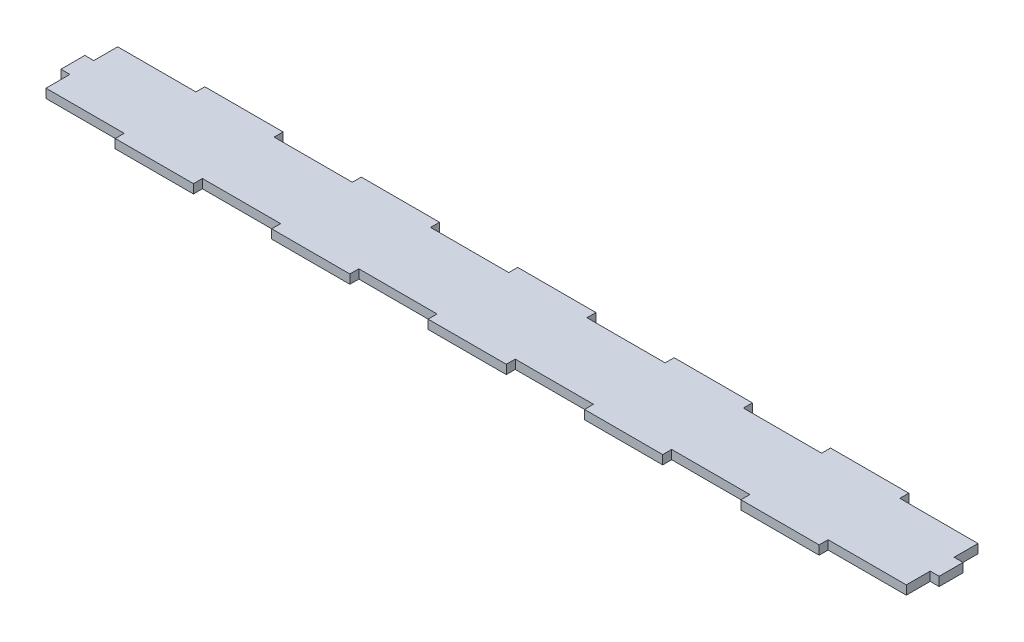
ISO-10303-21;
HEADER;
FILE_DESCRIPTION(('STEP AP214'),'2;1');
FILE_NAME('part.step','',(''),(''),'','','');
FILE_SCHEMA(('AUTOMOTIVE_DESIGN { 1 0 10303 214 1 1 1 1 }'));
ENDSEC;
DATA;
#1=APPLICATION_CONTEXT('core data for automotive mechanical design processes');
#2=APPLICATION_PROTOCOL_DEFINITION('international standard','automotive_design',2000,#1);
#3=PRODUCT_CONTEXT('',#1,'mechanical');
#4=PRODUCT('Part','Part','',(#3));
#5=PRODUCT_RELATED_PRODUCT_CATEGORY('part','',(#4));
#6=PRODUCT_DEFINITION_FORMATION('','',#4);
#7=PRODUCT_DEFINITION_CONTEXT('part definition',#1,'design');
#8=PRODUCT_DEFINITION('design','',#6,#7);
#9=PRODUCT_DEFINITION_SHAPE('','',#8);
#10=(LENGTH_UNIT() NAMED_UNIT(*) SI_UNIT(.MILLI.,.METRE.));
#11=(NAMED_UNIT(*) PLANE_ANGLE_UNIT() SI_UNIT($,.RADIAN.));
#12=(NAMED_UNIT(*) SI_UNIT($,.STERADIAN.) SOLID_ANGLE_UNIT());
#13=UNCERTAINTY_MEASURE_WITH_UNIT(LENGTH_MEASURE(1.E-05),#10,'distance_accuracy_value','');
#14=(GEOMETRIC_REPRESENTATION_CONTEXT(3) GLOBAL_UNCERTAINTY_ASSIGNED_CONTEXT((#13)) GLOBAL_UNIT_ASSIGNED_CONTEXT((#10,
#11,#12)) REPRESENTATION_CONTEXT('',''));
#15=CARTESIAN_POINT('',(0.,0.,0.));
#16=DIRECTION('',(0.,0.,1.));
#17=DIRECTION('',(1.,0.,0.));
#18=AXIS2_PLACEMENT_3D('',#15,#16,#17);
#19=CARTESIAN_POINT('',(-180.109090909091,3.175,-16.9333333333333));
#20=DIRECTION('',(1.,0.,0.));
#21=DIRECTION('',(0.,0.,-1.));
#22=AXIS2_PLACEMENT_3D('',#19,#20,#21);
#23=PLANE('',#22);
#24=DIRECTION('',(0.,0.,1.));
#25=VECTOR('',#24,1.);
#26=CARTESIAN_POINT('',(-180.109090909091,0.,-16.9333333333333));
#27=LINE('',#26,#25);
#28=CARTESIAN_POINT('',(-180.109090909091,0.,-25.4));
#29=VERTEX_POINT('',#28);
#30=CARTESIAN_POINT('',(-180.109090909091,0.,-16.9333333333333));
#31=VERTEX_POINT('',#30);
#32=EDGE_CURVE('E393',#29,#31,#27,.T.);
#33=ORIENTED_EDGE('',*,*,#32,.T.);
#34=DIRECTION('',(0.,-1.,0.));
#35=VECTOR('',#34,1.);
#36=CARTESIAN_POINT('',(-180.109090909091,3.175,-16.9333333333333));
#37=LINE('',#36,#35);
#38=CARTESIAN_POINT('',(-180.109090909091,3.175,-16.9333333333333));
#39=VERTEX_POINT('',#38);
#40=EDGE_CURVE('E11',#39,#31,#37,.T.);
#41=ORIENTED_EDGE('',*,*,#40,.F.);
#42=DIRECTION('',(0.,0.,1.));
#43=VECTOR('',#42,1.);
#44=CARTESIAN_POINT('',(-180.109090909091,3.175,-16.9333333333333));
#45=LINE('',#44,#43);
#46=CARTESIAN_POINT('',(-180.109090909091,3.175,-25.4));
#47=VERTEX_POINT('',#46);
#48=EDGE_CURVE('E495',#47,#39,#45,.T.);
#49=ORIENTED_EDGE('',*,*,#48,.F.);
#50=DIRECTION('',(0.,-1.,0.));
#51=VECTOR('',#50,1.);
#52=CARTESIAN_POINT('',(-180.109090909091,3.175,-25.4));
#53=LINE('',#52,#51);
#54=EDGE_CURVE('E389',#47,#29,#53,.T.);
#55=ORIENTED_EDGE('',*,*,#54,.T.);
#56=EDGE_LOOP('',(#33,#41,#49,#55));
#57=FACE_BOUND('',#56,.T.);
#58=ADVANCED_FACE('F33',(#57),#23,.F.);
#59=CARTESIAN_POINT('',(-183.284090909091,3.175,-16.9333333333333));
#60=DIRECTION('',(0.,0.,1.));
#61=DIRECTION('',(1.,0.,0.));
#62=AXIS2_PLACEMENT_3D('',#59,#60,#61);
#63=PLANE('',#62);
#64=DIRECTION('',(-1.,0.,0.));
#65=VECTOR('',#64,1.);
#66=CARTESIAN_POINT('',(-183.284090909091,0.,-16.9333333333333));
#67=LINE('',#66,#65);
#68=CARTESIAN_POINT('',(-183.284090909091,0.,-16.9333333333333));
#69=VERTEX_POINT('',#68);
#70=EDGE_CURVE('E396',#31,#69,#67,.T.);
#71=ORIENTED_EDGE('',*,*,#70,.T.);
#72=DIRECTION('',(0.,-1.,0.));
#73=VECTOR('',#72,1.);
#74=CARTESIAN_POINT('',(-183.284090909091,3.175,-16.9333333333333));
#75=LINE('',#74,#73);
#76=CARTESIAN_POINT('',(-183.284090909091,3.175,-16.9333333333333));
#77=VERTEX_POINT('',#76);
#78=EDGE_CURVE('E41',#77,#69,#75,.T.);
#79=ORIENTED_EDGE('',*,*,#78,.F.);
#80=DIRECTION('',(-1.,0.,0.));
#81=VECTOR('',#80,1.);
#82=CARTESIAN_POINT('',(-183.284090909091,3.175,-16.9333333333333));
#83=LINE('',#82,#81);
#84=EDGE_CURVE('E224',#39,#77,#83,.T.);
#85=ORIENTED_EDGE('',*,*,#84,.F.);
#86=ORIENTED_EDGE('',*,*,#40,.T.);
#87=EDGE_LOOP('',(#71,#79,#85,#86));
#88=FACE_BOUND('',#87,.T.);
#89=ADVANCED_FACE('F773',(#88),#63,.F.);
#90=CARTESIAN_POINT('',(-183.284090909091,3.175,-8.46666666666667));
#91=DIRECTION('',(1.,0.,0.));
#92=DIRECTION('',(0.,0.,-1.));
#93=AXIS2_PLACEMENT_3D('',#90,#91,#92);
#94=PLANE('',#93);
#95=DIRECTION('',(0.,0.,1.));
#96=VECTOR('',#95,1.);
#97=CARTESIAN_POINT('',(-183.284090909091,0.,-8.46666666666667));
#98=LINE('',#97,#96);
#99=CARTESIAN_POINT('',(-183.284090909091,0.,-8.46666666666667));
#100=VERTEX_POINT('',#99);
#101=EDGE_CURVE('E398',#69,#100,#98,.T.);
#102=ORIENTED_EDGE('',*,*,#101,.T.);
#103=DIRECTION('',(0.,-1.,0.));
#104=VECTOR('',#103,1.);
#105=CARTESIAN_POINT('',(-183.284090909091,3.175,-8.46666666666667));
#106=LINE('',#105,#104);
#107=CARTESIAN_POINT('',(-183.284090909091,3.175,-8.46666666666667));
#108=VERTEX_POINT('',#107);
#109=EDGE_CURVE('E634',#108,#100,#106,.T.);
#110=ORIENTED_EDGE('',*,*,#109,.F.);
#111=DIRECTION('',(0.,0.,1.));
#112=VECTOR('',#111,1.);
#113=CARTESIAN_POINT('',(-183.284090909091,3.175,-8.46666666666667));
#114=LINE('',#113,#112);
#115=EDGE_CURVE('E642',#77,#108,#114,.T.);
#116=ORIENTED_EDGE('',*,*,#115,.F.);
#117=ORIENTED_EDGE('',*,*,#78,.T.);
#118=EDGE_LOOP('',(#102,#110,#116,#117));
#119=FACE_BOUND('',#118,.T.);
#120=ADVANCED_FACE('F640',(#119),#94,.F.);
#121=CARTESIAN_POINT('',(-180.109090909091,3.175,-8.46666666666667));
#122=DIRECTION('',(0.,0.,-1.));
#123=DIRECTION('',(-1.,0.,0.));
#124=AXIS2_PLACEMENT_3D('',#121,#122,#123);
#125=PLANE('',#124);
#126=DIRECTION('',(1.,0.,0.));
#127=VECTOR('',#126,1.);
#128=CARTESIAN_POINT('',(-180.109090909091,0.,-8.46666666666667));
#129=LINE('',#128,#127);
#130=CARTESIAN_POINT('',(-180.109090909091,0.,-8.46666666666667));
#131=VERTEX_POINT('',#130);
#132=EDGE_CURVE('E400',#100,#131,#129,.T.);
#133=ORIENTED_EDGE('',*,*,#132,.T.);
#134=DIRECTION('',(0.,-1.,0.));
#135=VECTOR('',#134,1.);
#136=CARTESIAN_POINT('',(-180.109090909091,3.175,-8.46666666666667));
#137=LINE('',#136,#135);
#138=CARTESIAN_POINT('',(-180.109090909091,3.175,-8.46666666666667));
#139=VERTEX_POINT('',#138);
#140=EDGE_CURVE('E631',#139,#131,#137,.T.);
#141=ORIENTED_EDGE('',*,*,#140,.F.);
#142=DIRECTION('',(1.,0.,0.));
#143=VECTOR('',#142,1.);
#144=CARTESIAN_POINT('',(-180.109090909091,3.175,-8.46666666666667));
#145=LINE('',#144,#143);
#146=EDGE_CURVE('E660',#108,#139,#145,.T.);
#147=ORIENTED_EDGE('',*,*,#146,.F.);
#148=ORIENTED_EDGE('',*,*,#109,.T.);
#149=EDGE_LOOP('',(#133,#141,#147,#148));
#150=FACE_BOUND('',#149,.T.);
#151=ADVANCED_FACE('F651',(#150),#125,.F.);
#152=CARTESIAN_POINT('',(-180.109090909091,3.175,0.));
#153=DIRECTION('',(1.,0.,0.));
#154=DIRECTION('',(0.,0.,-1.));
#155=AXIS2_PLACEMENT_3D('',#152,#153,#154);
#156=PLANE('',#155);
#157=DIRECTION('',(0.,0.,1.));
#158=VECTOR('',#157,1.);
#159=CARTESIAN_POINT('',(-180.109090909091,0.,0.));
#160=LINE('',#159,#158);
#161=CARTESIAN_POINT('',(-180.109090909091,0.,0.));
#162=VERTEX_POINT('',#161);
#163=EDGE_CURVE('E402',#131,#162,#160,.T.);
#164=ORIENTED_EDGE('',*,*,#163,.T.);
#165=DIRECTION('',(0.,-1.,0.));
#166=VECTOR('',#165,1.);
#167=CARTESIAN_POINT('',(-180.109090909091,3.175,0.));
#168=LINE('',#167,#166);
#169=CARTESIAN_POINT('',(-180.109090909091,3.175,0.));
#170=VERTEX_POINT('',#169);
#171=EDGE_CURVE('E628',#170,#162,#168,.T.);
#172=ORIENTED_EDGE('',*,*,#171,.F.);
#173=DIRECTION('',(0.,0.,1.));
#174=VECTOR('',#173,1.);
#175=CARTESIAN_POINT('',(-180.109090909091,3.175,0.));
#176=LINE('',#175,#174);
#177=EDGE_CURVE('E657',#139,#170,#176,.T.);
#178=ORIENTED_EDGE('',*,*,#177,.F.);
#179=ORIENTED_EDGE('',*,*,#140,.T.);
#180=EDGE_LOOP('',(#164,#172,#178,#179));
#181=FACE_BOUND('',#180,.T.);
#182=ADVANCED_FACE('F655',(#181),#156,.F.);
#183=CARTESIAN_POINT('',(-152.4,3.175,0.));
#184=DIRECTION('',(0.,0.,-1.));
#185=DIRECTION('',(-1.,0.,0.));
#186=AXIS2_PLACEMENT_3D('',#183,#184,#185);
#187=PLANE('',#186);
#188=DIRECTION('',(1.,0.,0.));
#189=VECTOR('',#188,1.);
#190=CARTESIAN_POINT('',(-152.4,0.,0.));
#191=LINE('',#190,#189);
#192=CARTESIAN_POINT('',(-152.4,0.,0.));
#193=VERTEX_POINT('',#192);
#194=EDGE_CURVE('E404',#162,#193,#191,.T.);
#195=ORIENTED_EDGE('',*,*,#194,.T.);
#196=DIRECTION('',(0.,-1.,0.));
#197=VECTOR('',#196,1.);
#198=CARTESIAN_POINT('',(-152.4,3.175,0.));
#199=LINE('',#198,#197);
#200=CARTESIAN_POINT('',(-152.4,3.175,0.));
#201=VERTEX_POINT('',#200);
#202=EDGE_CURVE('E625',#201,#193,#199,.T.);
#203=ORIENTED_EDGE('',*,*,#202,.F.);
#204=DIRECTION('',(1.,0.,0.));
#205=VECTOR('',#204,1.);
#206=CARTESIAN_POINT('',(-152.4,3.175,0.));
#207=LINE('',#206,#205);
#208=EDGE_CURVE('E659',#170,#201,#207,.T.);
#209=ORIENTED_EDGE('',*,*,#208,.F.);
#210=ORIENTED_EDGE('',*,*,#171,.T.);
#211=EDGE_LOOP('',(#195,#203,#209,#210));
#212=FACE_BOUND('',#211,.T.);
#213=ADVANCED_FACE('F786',(#212),#187,.F.);
#214=CARTESIAN_POINT('',(-152.4,3.175,3.175));
#215=DIRECTION('',(1.,0.,0.));
#216=DIRECTION('',(0.,0.,-1.));
#217=AXIS2_PLACEMENT_3D('',#214,#215,#216);
#218=PLANE('',#217);
#219=DIRECTION('',(0.,0.,1.));
#220=VECTOR('',#219,1.);
#221=CARTESIAN_POINT('',(-152.4,0.,3.175));
#222=LINE('',#221,#220);
#223=CARTESIAN_POINT('',(-152.4,0.,3.175));
#224=VERTEX_POINT('',#223);
#225=EDGE_CURVE('E406',#193,#224,#222,.T.);
#226=ORIENTED_EDGE('',*,*,#225,.T.);
#227=DIRECTION('',(0.,-1.,0.));
#228=VECTOR('',#227,1.);
#229=CARTESIAN_POINT('',(-152.4,3.175,3.175));
#230=LINE('',#229,#228);
#231=CARTESIAN_POINT('',(-152.4,3.175,3.175));
#232=VERTEX_POINT('',#231);
#233=EDGE_CURVE('E622',#232,#224,#230,.T.);
#234=ORIENTED_EDGE('',*,*,#233,.F.);
#235=DIRECTION('',(0.,0.,1.));
#236=VECTOR('',#235,1.);
#237=CARTESIAN_POINT('',(-152.4,3.175,3.175));
#238=LINE('',#237,#236);
#239=EDGE_CURVE('E662',#201,#232,#238,.T.);
#240=ORIENTED_EDGE('',*,*,#239,.F.);
#241=ORIENTED_EDGE('',*,*,#202,.T.);
#242=EDGE_LOOP('',(#226,#234,#240,#241));
#243=FACE_BOUND('',#242,.T.);
#244=ADVANCED_FACE('F789',(#243),#218,.F.);
#245=CARTESIAN_POINT('',(-124.690909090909,3.175,3.175));
#246=DIRECTION('',(0.,0.,-1.));
#247=DIRECTION('',(-1.,0.,0.));
#248=AXIS2_PLACEMENT_3D('',#245,#246,#247);
#249=PLANE('',#248);
#250=DIRECTION('',(1.,0.,0.));
#251=VECTOR('',#250,1.);
#252=CARTESIAN_POINT('',(-124.690909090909,0.,3.175));
#253=LINE('',#252,#251);
#254=CARTESIAN_POINT('',(-124.690909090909,0.,3.175));
#255=VERTEX_POINT('',#254);
#256=EDGE_CURVE('E408',#224,#255,#253,.T.);
#257=ORIENTED_EDGE('',*,*,#256,.T.);
#258=DIRECTION('',(0.,-1.,0.));
#259=VECTOR('',#258,1.);
#260=CARTESIAN_POINT('',(-124.690909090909,3.175,3.175));
#261=LINE('',#260,#259);
#262=CARTESIAN_POINT('',(-124.690909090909,3.175,3.175));
#263=VERTEX_POINT('',#262);
#264=EDGE_CURVE('E619',#263,#255,#261,.T.);
#265=ORIENTED_EDGE('',*,*,#264,.F.);
#266=DIRECTION('',(1.,0.,0.));
#267=VECTOR('',#266,1.);
#268=CARTESIAN_POINT('',(-124.690909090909,3.175,3.175));
#269=LINE('',#268,#267);
#270=EDGE_CURVE('E668',#232,#263,#269,.T.);
#271=ORIENTED_EDGE('',*,*,#270,.F.);
#272=ORIENTED_EDGE('',*,*,#233,.T.);
#273=EDGE_LOOP('',(#257,#265,#271,#272));
#274=FACE_BOUND('',#273,.T.);
#275=ADVANCED_FACE('F793',(#274),#249,.F.);
#276=CARTESIAN_POINT('',(-124.690909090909,3.175,0.));
#277=DIRECTION('',(-1.,0.,0.));
#278=DIRECTION('',(0.,0.,1.));
#279=AXIS2_PLACEMENT_3D('',#276,#277,#278);
#280=PLANE('',#279);
#281=DIRECTION('',(0.,0.,-1.));
#282=VECTOR('',#281,1.);
#283=CARTESIAN_POINT('',(-124.690909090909,0.,0.));
#284=LINE('',#283,#282);
#285=CARTESIAN_POINT('',(-124.690909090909,0.,0.));
#286=VERTEX_POINT('',#285);
#287=EDGE_CURVE('E410',#255,#286,#284,.T.);
#288=ORIENTED_EDGE('',*,*,#287,.T.);
#289=DIRECTION('',(0.,-1.,0.));
#290=VECTOR('',#289,1.);
#291=CARTESIAN_POINT('',(-124.690909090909,3.175,0.));
#292=LINE('',#291,#290);
#293=CARTESIAN_POINT('',(-124.690909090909,3.175,0.));
#294=VERTEX_POINT('',#293);
#295=EDGE_CURVE('E616',#294,#286,#292,.T.);
#296=ORIENTED_EDGE('',*,*,#295,.F.);
#297=DIRECTION('',(0.,0.,-1.));
#298=VECTOR('',#297,1.);
#299=CARTESIAN_POINT('',(-124.690909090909,3.175,0.));
#300=LINE('',#299,#298);
#301=EDGE_CURVE('E670',#263,#294,#300,.T.);
#302=ORIENTED_EDGE('',*,*,#301,.F.);
#303=ORIENTED_EDGE('',*,*,#264,.T.);
#304=EDGE_LOOP('',(#288,#296,#302,#303));
#305=FACE_BOUND('',#304,.T.);
#306=ADVANCED_FACE('F797',(#305),#280,.F.);
#307=CARTESIAN_POINT('',(-96.9818181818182,3.175,0.));
#308=DIRECTION('',(0.,0.,-1.));
#309=DIRECTION('',(-1.,0.,0.));
#310=AXIS2_PLACEMENT_3D('',#307,#308,#309);
#311=PLANE('',#310);
#312=DIRECTION('',(1.,0.,0.));
#313=VECTOR('',#312,1.);
#314=CARTESIAN_POINT('',(-96.9818181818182,0.,0.));
#315=LINE('',#314,#313);
#316=CARTESIAN_POINT('',(-96.9818181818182,0.,0.));
#317=VERTEX_POINT('',#316);
#318=EDGE_CURVE('E412',#286,#317,#315,.T.);
#319=ORIENTED_EDGE('',*,*,#318,.T.);
#320=DIRECTION('',(0.,-1.,0.));
#321=VECTOR('',#320,1.);
#322=CARTESIAN_POINT('',(-96.9818181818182,3.175,0.));
#323=LINE('',#322,#321);
#324=CARTESIAN_POINT('',(-96.9818181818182,3.175,0.));
#325=VERTEX_POINT('',#324);
#326=EDGE_CURVE('E613',#325,#317,#323,.T.);
#327=ORIENTED_EDGE('',*,*,#326,.F.);
#328=DIRECTION('',(1.,0.,0.));
#329=VECTOR('',#328,1.);
#330=CARTESIAN_POINT('',(-96.9818181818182,3.175,0.));
#331=LINE('',#330,#329);
#332=EDGE_CURVE('E672',#294,#325,#331,.T.);
#333=ORIENTED_EDGE('',*,*,#332,.F.);
#334=ORIENTED_EDGE('',*,*,#295,.T.);
#335=EDGE_LOOP('',(#319,#327,#333,#334));
#336=FACE_BOUND('',#335,.T.);
#337=ADVANCED_FACE('F801',(#336),#311,.F.);
#338=CARTESIAN_POINT('',(-96.9818181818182,3.175,3.175));
#339=DIRECTION('',(1.,0.,0.));
#340=DIRECTION('',(0.,0.,-1.));
#341=AXIS2_PLACEMENT_3D('',#338,#339,#340);
#342=PLANE('',#341);
#343=DIRECTION('',(0.,0.,1.));
#344=VECTOR('',#343,1.);
#345=CARTESIAN_POINT('',(-96.9818181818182,0.,3.175));
#346=LINE('',#345,#344);
#347=CARTESIAN_POINT('',(-96.9818181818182,0.,3.175));
#348=VERTEX_POINT('',#347);
#349=EDGE_CURVE('E414',#317,#348,#346,.T.);
#350=ORIENTED_EDGE('',*,*,#349,.T.);
#351=DIRECTION('',(0.,-1.,0.));
#352=VECTOR('',#351,1.);
#353=CARTESIAN_POINT('',(-96.9818181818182,3.175,3.175));
#354=LINE('',#353,#352);
#355=CARTESIAN_POINT('',(-96.9818181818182,3.175,3.175));
#356=VERTEX_POINT('',#355);
#357=EDGE_CURVE('E610',#356,#348,#354,.T.);
#358=ORIENTED_EDGE('',*,*,#357,.F.);
#359=DIRECTION('',(0.,0.,1.));
#360=VECTOR('',#359,1.);
#361=CARTESIAN_POINT('',(-96.9818181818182,3.175,3.175));
#362=LINE('',#361,#360);
#363=EDGE_CURVE('E674',#325,#356,#362,.T.);
#364=ORIENTED_EDGE('',*,*,#363,.F.);
#365=ORIENTED_EDGE('',*,*,#326,.T.);
#366=EDGE_LOOP('',(#350,#358,#364,#365));
#367=FACE_BOUND('',#366,.T.);
#368=ADVANCED_FACE('F805',(#367),#342,.F.);
#369=CARTESIAN_POINT('',(-69.2727272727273,3.175,3.175));
#370=DIRECTION('',(0.,0.,-1.));
#371=DIRECTION('',(-1.,0.,0.));
#372=AXIS2_PLACEMENT_3D('',#369,#370,#371);
#373=PLANE('',#372);
#374=DIRECTION('',(1.,0.,0.));
#375=VECTOR('',#374,1.);
#376=CARTESIAN_POINT('',(-69.2727272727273,0.,3.175));
#377=LINE('',#376,#375);
#378=CARTESIAN_POINT('',(-69.2727272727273,0.,3.175));
#379=VERTEX_POINT('',#378);
#380=EDGE_CURVE('E416',#348,#379,#377,.T.);
#381=ORIENTED_EDGE('',*,*,#380,.T.);
#382=DIRECTION('',(0.,-1.,0.));
#383=VECTOR('',#382,1.);
#384=CARTESIAN_POINT('',(-69.2727272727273,3.175,3.175));
#385=LINE('',#384,#383);
#386=CARTESIAN_POINT('',(-69.2727272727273,3.175,3.175));
#387=VERTEX_POINT('',#386);
#388=EDGE_CURVE('E607',#387,#379,#385,.T.);
#389=ORIENTED_EDGE('',*,*,#388,.F.);
#390=DIRECTION('',(1.,0.,0.));
#391=VECTOR('',#390,1.);
#392=CARTESIAN_POINT('',(-69.2727272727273,3.175,3.175));
#393=LINE('',#392,#391);
#394=EDGE_CURVE('E676',#356,#387,#393,.T.);
#395=ORIENTED_EDGE('',*,*,#394,.F.);
#396=ORIENTED_EDGE('',*,*,#357,.T.);
#397=EDGE_LOOP('',(#381,#389,#395,#396));
#398=FACE_BOUND('',#397,.T.);
#399=ADVANCED_FACE('F809',(#398),#373,.F.);
#400=CARTESIAN_POINT('',(-69.2727272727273,3.175,0.));
#401=DIRECTION('',(-1.,0.,0.));
#402=DIRECTION('',(0.,0.,1.));
#403=AXIS2_PLACEMENT_3D('',#400,#401,#402);
#404=PLANE('',#403);
#405=DIRECTION('',(0.,0.,-1.));
#406=VECTOR('',#405,1.);
#407=CARTESIAN_POINT('',(-69.2727272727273,0.,0.));
#408=LINE('',#407,#406);
#409=CARTESIAN_POINT('',(-69.2727272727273,0.,0.));
#410=VERTEX_POINT('',#409);
#411=EDGE_CURVE('E418',#379,#410,#408,.T.);
#412=ORIENTED_EDGE('',*,*,#411,.T.);
#413=DIRECTION('',(0.,-1.,0.));
#414=VECTOR('',#413,1.);
#415=CARTESIAN_POINT('',(-69.2727272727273,3.175,0.));
#416=LINE('',#415,#414);
#417=CARTESIAN_POINT('',(-69.2727272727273,3.175,0.));
#418=VERTEX_POINT('',#417);
#419=EDGE_CURVE('E604',#418,#410,#416,.T.);
#420=ORIENTED_EDGE('',*,*,#419,.F.);
#421=DIRECTION('',(0.,0.,-1.));
#422=VECTOR('',#421,1.);
#423=CARTESIAN_POINT('',(-69.2727272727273,3.175,0.));
#424=LINE('',#423,#422);
#425=EDGE_CURVE('E678',#387,#418,#424,.T.);
#426=ORIENTED_EDGE('',*,*,#425,.F.);
#427=ORIENTED_EDGE('',*,*,#388,.T.);
#428=EDGE_LOOP('',(#412,#420,#426,#427));
#429=FACE_BOUND('',#428,.T.);
#430=ADVANCED_FACE('F813',(#429),#404,.F.);
#431=CARTESIAN_POINT('',(-41.5636363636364,3.175,0.));
#432=DIRECTION('',(0.,0.,-1.));
#433=DIRECTION('',(-1.,0.,0.));
#434=AXIS2_PLACEMENT_3D('',#431,#432,#433);
#435=PLANE('',#434);
#436=DIRECTION('',(1.,0.,0.));
#437=VECTOR('',#436,1.);
#438=CARTESIAN_POINT('',(-41.5636363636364,0.,0.));
#439=LINE('',#438,#437);
#440=CARTESIAN_POINT('',(-41.5636363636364,0.,0.));
#441=VERTEX_POINT('',#440);
#442=EDGE_CURVE('E420',#410,#441,#439,.T.);
#443=ORIENTED_EDGE('',*,*,#442,.T.);
#444=DIRECTION('',(0.,-1.,0.));
#445=VECTOR('',#444,1.);
#446=CARTESIAN_POINT('',(-41.5636363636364,3.175,0.));
#447=LINE('',#446,#445);
#448=CARTESIAN_POINT('',(-41.5636363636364,3.175,0.));
#449=VERTEX_POINT('',#448);
#450=EDGE_CURVE('E601',#449,#441,#447,.T.);
#451=ORIENTED_EDGE('',*,*,#450,.F.);
#452=DIRECTION('',(1.,0.,0.));
#453=VECTOR('',#452,1.);
#454=CARTESIAN_POINT('',(-41.5636363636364,3.175,0.));
#455=LINE('',#454,#453);
#456=EDGE_CURVE('E680',#418,#449,#455,.T.);
#457=ORIENTED_EDGE('',*,*,#456,.F.);
#458=ORIENTED_EDGE('',*,*,#419,.T.);
#459=EDGE_LOOP('',(#443,#451,#457,#458));
#460=FACE_BOUND('',#459,.T.);
#461=ADVANCED_FACE('F817',(#460),#435,.F.);
#462=CARTESIAN_POINT('',(-41.5636363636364,3.175,3.175));
#463=DIRECTION('',(1.,0.,0.));
#464=DIRECTION('',(0.,0.,-1.));
#465=AXIS2_PLACEMENT_3D('',#462,#463,#464);
#466=PLANE('',#465);
#467=DIRECTION('',(0.,0.,1.));
#468=VECTOR('',#467,1.);
#469=CARTESIAN_POINT('',(-41.5636363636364,0.,3.175));
#470=LINE('',#469,#468);
#471=CARTESIAN_POINT('',(-41.5636363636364,0.,3.175));
#472=VERTEX_POINT('',#471);
#473=EDGE_CURVE('E422',#441,#472,#470,.T.);
#474=ORIENTED_EDGE('',*,*,#473,.T.);
#475=DIRECTION('',(0.,-1.,0.));
#476=VECTOR('',#475,1.);
#477=CARTESIAN_POINT('',(-41.5636363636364,3.175,3.175));
#478=LINE('',#477,#476);
#479=CARTESIAN_POINT('',(-41.5636363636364,3.175,3.175));
#480=VERTEX_POINT('',#479);
#481=EDGE_CURVE('E598',#480,#472,#478,.T.);
#482=ORIENTED_EDGE('',*,*,#481,.F.);
#483=DIRECTION('',(0.,0.,1.));
#484=VECTOR('',#483,1.);
#485=CARTESIAN_POINT('',(-41.5636363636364,3.175,3.175));
#486=LINE('',#485,#484);
#487=EDGE_CURVE('E682',#449,#480,#486,.T.);
#488=ORIENTED_EDGE('',*,*,#487,.F.);
#489=ORIENTED_EDGE('',*,*,#450,.T.);
#490=EDGE_LOOP('',(#474,#482,#488,#489));
#491=FACE_BOUND('',#490,.T.);
#492=ADVANCED_FACE('F821',(#491),#466,.F.);
#493=CARTESIAN_POINT('',(-13.8545454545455,3.175,3.175));
#494=DIRECTION('',(0.,0.,-1.));
#495=DIRECTION('',(-1.,0.,0.));
#496=AXIS2_PLACEMENT_3D('',#493,#494,#495);
#497=PLANE('',#496);
#498=DIRECTION('',(1.,0.,0.));
#499=VECTOR('',#498,1.);
#500=CARTESIAN_POINT('',(-13.8545454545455,0.,3.175));
#501=LINE('',#500,#499);
#502=CARTESIAN_POINT('',(-13.8545454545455,0.,3.175));
#503=VERTEX_POINT('',#502);
#504=EDGE_CURVE('E424',#472,#503,#501,.T.);
#505=ORIENTED_EDGE('',*,*,#504,.T.);
#506=DIRECTION('',(0.,-1.,0.));
#507=VECTOR('',#506,1.);
#508=CARTESIAN_POINT('',(-13.8545454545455,3.175,3.175));
#509=LINE('',#508,#507);
#510=CARTESIAN_POINT('',(-13.8545454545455,3.175,3.175));
#511=VERTEX_POINT('',#510);
#512=EDGE_CURVE('E595',#511,#503,#509,.T.);
#513=ORIENTED_EDGE('',*,*,#512,.F.);
#514=DIRECTION('',(1.,0.,0.));
#515=VECTOR('',#514,1.);
#516=CARTESIAN_POINT('',(-13.8545454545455,3.175,3.175));
#517=LINE('',#516,#515);
#518=EDGE_CURVE('E684',#480,#511,#517,.T.);
#519=ORIENTED_EDGE('',*,*,#518,.F.);
#520=ORIENTED_EDGE('',*,*,#481,.T.);
#521=EDGE_LOOP('',(#505,#513,#519,#520));
#522=FACE_BOUND('',#521,.T.);
#523=ADVANCED_FACE('F825',(#522),#497,.F.);
#524=CARTESIAN_POINT('',(-13.8545454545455,3.175,0.));
#525=DIRECTION('',(-1.,0.,0.));
#526=DIRECTION('',(0.,0.,1.));
#527=AXIS2_PLACEMENT_3D('',#524,#525,#526);
#528=PLANE('',#527);
#529=DIRECTION('',(0.,0.,-1.));
#530=VECTOR('',#529,1.);
#531=CARTESIAN_POINT('',(-13.8545454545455,0.,0.));
#532=LINE('',#531,#530);
#533=CARTESIAN_POINT('',(-13.8545454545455,0.,0.));
#534=VERTEX_POINT('',#533);
#535=EDGE_CURVE('E426',#503,#534,#532,.T.);
#536=ORIENTED_EDGE('',*,*,#535,.T.);
#537=DIRECTION('',(0.,-1.,0.));
#538=VECTOR('',#537,1.);
#539=CARTESIAN_POINT('',(-13.8545454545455,3.175,0.));
#540=LINE('',#539,#538);
#541=CARTESIAN_POINT('',(-13.8545454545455,3.175,0.));
#542=VERTEX_POINT('',#541);
#543=EDGE_CURVE('E592',#542,#534,#540,.T.);
#544=ORIENTED_EDGE('',*,*,#543,.F.);
#545=DIRECTION('',(0.,0.,-1.));
#546=VECTOR('',#545,1.);
#547=CARTESIAN_POINT('',(-13.8545454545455,3.175,0.));
#548=LINE('',#547,#546);
#549=EDGE_CURVE('E686',#511,#542,#548,.T.);
#550=ORIENTED_EDGE('',*,*,#549,.F.);
#551=ORIENTED_EDGE('',*,*,#512,.T.);
#552=EDGE_LOOP('',(#536,#544,#550,#551));
#553=FACE_BOUND('',#552,.T.);
#554=ADVANCED_FACE('F829',(#553),#528,.F.);
#555=CARTESIAN_POINT('',(13.8545454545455,3.175,0.));
#556=DIRECTION('',(0.,0.,-1.));
#557=DIRECTION('',(-1.,0.,0.));
#558=AXIS2_PLACEMENT_3D('',#555,#556,#557);
#559=PLANE('',#558);
#560=DIRECTION('',(1.,0.,0.));
#561=VECTOR('',#560,1.);
#562=CARTESIAN_POINT('',(13.8545454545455,0.,0.));
#563=LINE('',#562,#561);
#564=CARTESIAN_POINT('',(13.8545454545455,0.,0.));
#565=VERTEX_POINT('',#564);
#566=EDGE_CURVE('E428',#534,#565,#563,.T.);
#567=ORIENTED_EDGE('',*,*,#566,.T.);
#568=DIRECTION('',(0.,-1.,0.));
#569=VECTOR('',#568,1.);
#570=CARTESIAN_POINT('',(13.8545454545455,3.175,0.));
#571=LINE('',#570,#569);
#572=CARTESIAN_POINT('',(13.8545454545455,3.175,0.));
#573=VERTEX_POINT('',#572);
#574=EDGE_CURVE('E589',#573,#565,#571,.T.);
#575=ORIENTED_EDGE('',*,*,#574,.F.);
#576=DIRECTION('',(1.,0.,0.));
#577=VECTOR('',#576,1.);
#578=CARTESIAN_POINT('',(13.8545454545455,3.175,0.));
#579=LINE('',#578,#577);
#580=EDGE_CURVE('E688',#542,#573,#579,.T.);
#581=ORIENTED_EDGE('',*,*,#580,.F.);
#582=ORIENTED_EDGE('',*,*,#543,.T.);
#583=EDGE_LOOP('',(#567,#575,#581,#582));
#584=FACE_BOUND('',#583,.T.);
#585=ADVANCED_FACE('F833',(#584),#559,.F.);
#586=CARTESIAN_POINT('',(13.8545454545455,3.175,3.17499999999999));
#587=DIRECTION('',(1.,0.,0.));
#588=DIRECTION('',(0.,0.,-1.));
#589=AXIS2_PLACEMENT_3D('',#586,#587,#588);
#590=PLANE('',#589);
#591=DIRECTION('',(0.,0.,1.));
#592=VECTOR('',#591,1.);
#593=CARTESIAN_POINT('',(13.8545454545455,0.,3.17499999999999));
#594=LINE('',#593,#592);
#595=CARTESIAN_POINT('',(13.8545454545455,0.,3.17499999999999));
#596=VERTEX_POINT('',#595);
#597=EDGE_CURVE('E430',#565,#596,#594,.T.);
#598=ORIENTED_EDGE('',*,*,#597,.T.);
#599=DIRECTION('',(0.,-1.,0.));
#600=VECTOR('',#599,1.);
#601=CARTESIAN_POINT('',(13.8545454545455,3.175,3.17499999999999));
#602=LINE('',#601,#600);
#603=CARTESIAN_POINT('',(13.8545454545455,3.175,3.17499999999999));
#604=VERTEX_POINT('',#603);
#605=EDGE_CURVE('E586',#604,#596,#602,.T.);
#606=ORIENTED_EDGE('',*,*,#605,.F.);
#607=DIRECTION('',(0.,0.,1.));
#608=VECTOR('',#607,1.);
#609=CARTESIAN_POINT('',(13.8545454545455,3.175,3.17499999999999));
#610=LINE('',#609,#608);
#611=EDGE_CURVE('E690',#573,#604,#610,.T.);
#612=ORIENTED_EDGE('',*,*,#611,.F.);
#613=ORIENTED_EDGE('',*,*,#574,.T.);
#614=EDGE_LOOP('',(#598,#606,#612,#613));
#615=FACE_BOUND('',#614,.T.);
#616=ADVANCED_FACE('F837',(#615),#590,.F.);
#617=CARTESIAN_POINT('',(41.5636363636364,3.175,3.17499999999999));
#618=DIRECTION('',(0.,0.,-1.));
#619=DIRECTION('',(-1.,0.,0.));
#620=AXIS2_PLACEMENT_3D('',#617,#618,#619);
#621=PLANE('',#620);
#622=DIRECTION('',(1.,0.,0.));
#623=VECTOR('',#622,1.);
#624=CARTESIAN_POINT('',(41.5636363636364,0.,3.17499999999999));
#625=LINE('',#624,#623);
#626=CARTESIAN_POINT('',(41.5636363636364,0.,3.17499999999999));
#627=VERTEX_POINT('',#626);
#628=EDGE_CURVE('E432',#596,#627,#625,.T.);
#629=ORIENTED_EDGE('',*,*,#628,.T.);
#630=DIRECTION('',(0.,-1.,0.));
#631=VECTOR('',#630,1.);
#632=CARTESIAN_POINT('',(41.5636363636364,3.175,3.17499999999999));
#633=LINE('',#632,#631);
#634=CARTESIAN_POINT('',(41.5636363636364,3.175,3.17499999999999));
#635=VERTEX_POINT('',#634);
#636=EDGE_CURVE('E583',#635,#627,#633,.T.);
#637=ORIENTED_EDGE('',*,*,#636,.F.);
#638=DIRECTION('',(1.,0.,0.));
#639=VECTOR('',#638,1.);
#640=CARTESIAN_POINT('',(41.5636363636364,3.175,3.17499999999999));
#641=LINE('',#640,#639);
#642=EDGE_CURVE('E692',#604,#635,#641,.T.);
#643=ORIENTED_EDGE('',*,*,#642,.F.);
#644=ORIENTED_EDGE('',*,*,#605,.T.);
#645=EDGE_LOOP('',(#629,#637,#643,#644));
#646=FACE_BOUND('',#645,.T.);
#647=ADVANCED_FACE('F841',(#646),#621,.F.);
#648=CARTESIAN_POINT('',(41.5636363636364,3.175,0.));
#649=DIRECTION('',(-1.,0.,0.));
#650=DIRECTION('',(0.,0.,1.));
#651=AXIS2_PLACEMENT_3D('',#648,#649,#650);
#652=PLANE('',#651);
#653=DIRECTION('',(0.,0.,-1.));
#654=VECTOR('',#653,1.);
#655=CARTESIAN_POINT('',(41.5636363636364,0.,0.));
#656=LINE('',#655,#654);
#657=CARTESIAN_POINT('',(41.5636363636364,0.,0.));
#658=VERTEX_POINT('',#657);
#659=EDGE_CURVE('E434',#627,#658,#656,.T.);
#660=ORIENTED_EDGE('',*,*,#659,.T.);
#661=DIRECTION('',(0.,-1.,0.));
#662=VECTOR('',#661,1.);
#663=CARTESIAN_POINT('',(41.5636363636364,3.175,0.));
#664=LINE('',#663,#662);
#665=CARTESIAN_POINT('',(41.5636363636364,3.175,0.));
#666=VERTEX_POINT('',#665);
#667=EDGE_CURVE('E580',#666,#658,#664,.T.);
#668=ORIENTED_EDGE('',*,*,#667,.F.);
#669=DIRECTION('',(0.,0.,-1.));
#670=VECTOR('',#669,1.);
#671=CARTESIAN_POINT('',(41.5636363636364,3.175,0.));
#672=LINE('',#671,#670);
#673=EDGE_CURVE('E694',#635,#666,#672,.T.);
#674=ORIENTED_EDGE('',*,*,#673,.F.);
#675=ORIENTED_EDGE('',*,*,#636,.T.);
#676=EDGE_LOOP('',(#660,#668,#674,#675));
#677=FACE_BOUND('',#676,.T.);
#678=ADVANCED_FACE('F845',(#677),#652,.F.);
#679=CARTESIAN_POINT('',(69.2727272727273,3.175,0.));
#680=DIRECTION('',(0.,0.,-1.));
#681=DIRECTION('',(-1.,0.,0.));
#682=AXIS2_PLACEMENT_3D('',#679,#680,#681);
#683=PLANE('',#682);
#684=DIRECTION('',(1.,0.,0.));
#685=VECTOR('',#684,1.);
#686=CARTESIAN_POINT('',(69.2727272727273,0.,0.));
#687=LINE('',#686,#685);
#688=CARTESIAN_POINT('',(69.2727272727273,0.,0.));
#689=VERTEX_POINT('',#688);
#690=EDGE_CURVE('E436',#658,#689,#687,.T.);
#691=ORIENTED_EDGE('',*,*,#690,.T.);
#692=DIRECTION('',(0.,-1.,0.));
#693=VECTOR('',#692,1.);
#694=CARTESIAN_POINT('',(69.2727272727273,3.175,0.));
#695=LINE('',#694,#693);
#696=CARTESIAN_POINT('',(69.2727272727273,3.175,0.));
#697=VERTEX_POINT('',#696);
#698=EDGE_CURVE('E577',#697,#689,#695,.T.);
#699=ORIENTED_EDGE('',*,*,#698,.F.);
#700=DIRECTION('',(1.,0.,0.));
#701=VECTOR('',#700,1.);
#702=CARTESIAN_POINT('',(69.2727272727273,3.175,0.));
#703=LINE('',#702,#701);
#704=EDGE_CURVE('E696',#666,#697,#703,.T.);
#705=ORIENTED_EDGE('',*,*,#704,.F.);
#706=ORIENTED_EDGE('',*,*,#667,.T.);
#707=EDGE_LOOP('',(#691,#699,#705,#706));
#708=FACE_BOUND('',#707,.T.);
#709=ADVANCED_FACE('F849',(#708),#683,.F.);
#710=CARTESIAN_POINT('',(69.2727272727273,3.175,3.17499999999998));
#711=DIRECTION('',(1.,0.,0.));
#712=DIRECTION('',(0.,0.,-1.));
#713=AXIS2_PLACEMENT_3D('',#710,#711,#712);
#714=PLANE('',#713);
#715=DIRECTION('',(0.,0.,1.));
#716=VECTOR('',#715,1.);
#717=CARTESIAN_POINT('',(69.2727272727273,0.,3.17499999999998));
#718=LINE('',#717,#716);
#719=CARTESIAN_POINT('',(69.2727272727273,0.,3.17499999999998));
#720=VERTEX_POINT('',#719);
#721=EDGE_CURVE('E438',#689,#720,#718,.T.);
#722=ORIENTED_EDGE('',*,*,#721,.T.);
#723=DIRECTION('',(0.,-1.,0.));
#724=VECTOR('',#723,1.);
#725=CARTESIAN_POINT('',(69.2727272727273,3.175,3.17499999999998));
#726=LINE('',#725,#724);
#727=CARTESIAN_POINT('',(69.2727272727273,3.175,3.17499999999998));
#728=VERTEX_POINT('',#727);
#729=EDGE_CURVE('E574',#728,#720,#726,.T.);
#730=ORIENTED_EDGE('',*,*,#729,.F.);
#731=DIRECTION('',(0.,0.,1.));
#732=VECTOR('',#731,1.);
#733=CARTESIAN_POINT('',(69.2727272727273,3.175,3.17499999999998));
#734=LINE('',#733,#732);
#735=EDGE_CURVE('E698',#697,#728,#734,.T.);
#736=ORIENTED_EDGE('',*,*,#735,.F.);
#737=ORIENTED_EDGE('',*,*,#698,.T.);
#738=EDGE_LOOP('',(#722,#730,#736,#737));
#739=FACE_BOUND('',#738,.T.);
#740=ADVANCED_FACE('F853',(#739),#714,.F.);
#741=CARTESIAN_POINT('',(96.9818181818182,3.175,3.17499999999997));
#742=DIRECTION('',(0.,0.,-1.));
#743=DIRECTION('',(-1.,0.,0.));
#744=AXIS2_PLACEMENT_3D('',#741,#742,#743);
#745=PLANE('',#744);
#746=DIRECTION('',(1.,0.,0.));
#747=VECTOR('',#746,1.);
#748=CARTESIAN_POINT('',(96.9818181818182,0.,3.17499999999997));
#749=LINE('',#748,#747);
#750=CARTESIAN_POINT('',(96.9818181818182,0.,3.17499999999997));
#751=VERTEX_POINT('',#750);
#752=EDGE_CURVE('E440',#720,#751,#749,.T.);
#753=ORIENTED_EDGE('',*,*,#752,.T.);
#754=DIRECTION('',(0.,-1.,0.));
#755=VECTOR('',#754,1.);
#756=CARTESIAN_POINT('',(96.9818181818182,3.175,3.17499999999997));
#757=LINE('',#756,#755);
#758=CARTESIAN_POINT('',(96.9818181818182,3.175,3.17499999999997));
#759=VERTEX_POINT('',#758);
#760=EDGE_CURVE('E571',#759,#751,#757,.T.);
#761=ORIENTED_EDGE('',*,*,#760,.F.);
#762=DIRECTION('',(1.,0.,0.));
#763=VECTOR('',#762,1.);
#764=CARTESIAN_POINT('',(96.9818181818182,3.175,3.17499999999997));
#765=LINE('',#764,#763);
#766=EDGE_CURVE('E700',#728,#759,#765,.T.);
#767=ORIENTED_EDGE('',*,*,#766,.F.);
#768=ORIENTED_EDGE('',*,*,#729,.T.);
#769=EDGE_LOOP('',(#753,#761,#767,#768));
#770=FACE_BOUND('',#769,.T.);
#771=ADVANCED_FACE('F857',(#770),#745,.F.);
#772=CARTESIAN_POINT('',(96.9818181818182,3.175,0.));
#773=DIRECTION('',(-1.,0.,0.));
#774=DIRECTION('',(0.,0.,1.));
#775=AXIS2_PLACEMENT_3D('',#772,#773,#774);
#776=PLANE('',#775);
#777=DIRECTION('',(0.,0.,-1.));
#778=VECTOR('',#777,1.);
#779=CARTESIAN_POINT('',(96.9818181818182,0.,0.));
#780=LINE('',#779,#778);
#781=CARTESIAN_POINT('',(96.9818181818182,0.,0.));
#782=VERTEX_POINT('',#781);
#783=EDGE_CURVE('E442',#751,#782,#780,.T.);
#784=ORIENTED_EDGE('',*,*,#783,.T.);
#785=DIRECTION('',(0.,-1.,0.));
#786=VECTOR('',#785,1.);
#787=CARTESIAN_POINT('',(96.9818181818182,3.175,0.));
#788=LINE('',#787,#786);
#789=CARTESIAN_POINT('',(96.9818181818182,3.175,0.));
#790=VERTEX_POINT('',#789);
#791=EDGE_CURVE('E568',#790,#782,#788,.T.);
#792=ORIENTED_EDGE('',*,*,#791,.F.);
#793=DIRECTION('',(0.,0.,-1.));
#794=VECTOR('',#793,1.);
#795=CARTESIAN_POINT('',(96.9818181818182,3.175,0.));
#796=LINE('',#795,#794);
#797=EDGE_CURVE('E702',#759,#790,#796,.T.);
#798=ORIENTED_EDGE('',*,*,#797,.F.);
#799=ORIENTED_EDGE('',*,*,#760,.T.);
#800=EDGE_LOOP('',(#784,#792,#798,#799));
#801=FACE_BOUND('',#800,.T.);
#802=ADVANCED_FACE('F861',(#801),#776,.F.);
#803=CARTESIAN_POINT('',(124.690909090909,3.175,0.));
#804=DIRECTION('',(0.,0.,-1.));
#805=DIRECTION('',(-1.,0.,0.));
#806=AXIS2_PLACEMENT_3D('',#803,#804,#805);
#807=PLANE('',#806);
#808=DIRECTION('',(1.,0.,0.));
#809=VECTOR('',#808,1.);
#810=CARTESIAN_POINT('',(124.690909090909,0.,0.));
#811=LINE('',#810,#809);
#812=CARTESIAN_POINT('',(124.690909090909,0.,0.));
#813=VERTEX_POINT('',#812);
#814=EDGE_CURVE('E444',#782,#813,#811,.T.);
#815=ORIENTED_EDGE('',*,*,#814,.T.);
#816=DIRECTION('',(0.,-1.,0.));
#817=VECTOR('',#816,1.);
#818=CARTESIAN_POINT('',(124.690909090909,3.175,0.));
#819=LINE('',#818,#817);
#820=CARTESIAN_POINT('',(124.690909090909,3.175,0.));
#821=VERTEX_POINT('',#820);
#822=EDGE_CURVE('E565',#821,#813,#819,.T.);
#823=ORIENTED_EDGE('',*,*,#822,.F.);
#824=DIRECTION('',(1.,0.,0.));
#825=VECTOR('',#824,1.);
#826=CARTESIAN_POINT('',(124.690909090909,3.175,0.));
#827=LINE('',#826,#825);
#828=EDGE_CURVE('E704',#790,#821,#827,.T.);
#829=ORIENTED_EDGE('',*,*,#828,.F.);
#830=ORIENTED_EDGE('',*,*,#791,.T.);
#831=EDGE_LOOP('',(#815,#823,#829,#830));
#832=FACE_BOUND('',#831,.T.);
#833=ADVANCED_FACE('F865',(#832),#807,.F.);
#834=CARTESIAN_POINT('',(124.690909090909,3.175,-8.46666666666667));
#835=DIRECTION('',(-1.,0.,0.));
#836=DIRECTION('',(0.,0.,1.));
#837=AXIS2_PLACEMENT_3D('',#834,#835,#836);
#838=PLANE('',#837);
#839=DIRECTION('',(0.,0.,-1.));
#840=VECTOR('',#839,1.);
#841=CARTESIAN_POINT('',(124.690909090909,0.,-8.46666666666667));
#842=LINE('',#841,#840);
#843=CARTESIAN_POINT('',(124.690909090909,0.,-8.46666666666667));
#844=VERTEX_POINT('',#843);
#845=EDGE_CURVE('E446',#813,#844,#842,.T.);
#846=ORIENTED_EDGE('',*,*,#845,.T.);
#847=DIRECTION('',(0.,-1.,0.));
#848=VECTOR('',#847,1.);
#849=CARTESIAN_POINT('',(124.690909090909,3.175,-8.46666666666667));
#850=LINE('',#849,#848);
#851=CARTESIAN_POINT('',(124.690909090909,3.175,-8.46666666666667));
#852=VERTEX_POINT('',#851);
#853=EDGE_CURVE('E562',#852,#844,#850,.T.);
#854=ORIENTED_EDGE('',*,*,#853,.F.);
#855=DIRECTION('',(0.,0.,-1.));
#856=VECTOR('',#855,1.);
#857=CARTESIAN_POINT('',(124.690909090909,3.175,-8.46666666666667));
#858=LINE('',#857,#856);
#859=EDGE_CURVE('E706',#821,#852,#858,.T.);
#860=ORIENTED_EDGE('',*,*,#859,.F.);
#861=ORIENTED_EDGE('',*,*,#822,.T.);
#862=EDGE_LOOP('',(#846,#854,#860,#861));
#863=FACE_BOUND('',#862,.T.);
#864=ADVANCED_FACE('F869',(#863),#838,.F.);
#865=CARTESIAN_POINT('',(127.865909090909,3.175,-8.46666666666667));
#866=DIRECTION('',(0.,0.,-1.));
#867=DIRECTION('',(-1.,0.,0.));
#868=AXIS2_PLACEMENT_3D('',#865,#866,#867);
#869=PLANE('',#868);
#870=DIRECTION('',(1.,0.,0.));
#871=VECTOR('',#870,1.);
#872=CARTESIAN_POINT('',(127.865909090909,0.,-8.46666666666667));
#873=LINE('',#872,#871);
#874=CARTESIAN_POINT('',(127.865909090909,0.,-8.46666666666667));
#875=VERTEX_POINT('',#874);
#876=EDGE_CURVE('E448',#844,#875,#873,.T.);
#877=ORIENTED_EDGE('',*,*,#876,.T.);
#878=DIRECTION('',(0.,-1.,0.));
#879=VECTOR('',#878,1.);
#880=CARTESIAN_POINT('',(127.865909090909,3.175,-8.46666666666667));
#881=LINE('',#880,#879);
#882=CARTESIAN_POINT('',(127.865909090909,3.175,-8.46666666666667));
#883=VERTEX_POINT('',#882);
#884=EDGE_CURVE('E559',#883,#875,#881,.T.);
#885=ORIENTED_EDGE('',*,*,#884,.F.);
#886=DIRECTION('',(1.,0.,0.));
#887=VECTOR('',#886,1.);
#888=CARTESIAN_POINT('',(127.865909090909,3.175,-8.46666666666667));
#889=LINE('',#888,#887);
#890=EDGE_CURVE('E708',#852,#883,#889,.T.);
#891=ORIENTED_EDGE('',*,*,#890,.F.);
#892=ORIENTED_EDGE('',*,*,#853,.T.);
#893=EDGE_LOOP('',(#877,#885,#891,#892));
#894=FACE_BOUND('',#893,.T.);
#895=ADVANCED_FACE('F873',(#894),#869,.F.);
#896=CARTESIAN_POINT('',(127.865909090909,3.175,-16.9333333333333));
#897=DIRECTION('',(-1.,0.,0.));
#898=DIRECTION('',(0.,0.,1.));
#899=AXIS2_PLACEMENT_3D('',#896,#897,#898);
#900=PLANE('',#899);
#901=DIRECTION('',(0.,0.,-1.));
#902=VECTOR('',#901,1.);
#903=CARTESIAN_POINT('',(127.865909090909,0.,-16.9333333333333));
#904=LINE('',#903,#902);
#905=CARTESIAN_POINT('',(127.865909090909,0.,-16.9333333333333));
#906=VERTEX_POINT('',#905);
#907=EDGE_CURVE('E450',#875,#906,#904,.T.);
#908=ORIENTED_EDGE('',*,*,#907,.T.);
#909=DIRECTION('',(0.,-1.,0.));
#910=VECTOR('',#909,1.);
#911=CARTESIAN_POINT('',(127.865909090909,3.175,-16.9333333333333));
#912=LINE('',#911,#910);
#913=CARTESIAN_POINT('',(127.865909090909,3.175,-16.9333333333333));
#914=VERTEX_POINT('',#913);
#915=EDGE_CURVE('E556',#914,#906,#912,.T.);
#916=ORIENTED_EDGE('',*,*,#915,.F.);
#917=DIRECTION('',(0.,0.,-1.));
#918=VECTOR('',#917,1.);
#919=CARTESIAN_POINT('',(127.865909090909,3.175,-16.9333333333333));
#920=LINE('',#919,#918);
#921=EDGE_CURVE('E710',#883,#914,#920,.T.);
#922=ORIENTED_EDGE('',*,*,#921,.F.);
#923=ORIENTED_EDGE('',*,*,#884,.T.);
#924=EDGE_LOOP('',(#908,#916,#922,#923));
#925=FACE_BOUND('',#924,.T.);
#926=ADVANCED_FACE('F877',(#925),#900,.F.);
#927=CARTESIAN_POINT('',(124.690909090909,3.175,-16.9333333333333));
#928=DIRECTION('',(0.,0.,1.));
#929=DIRECTION('',(1.,0.,0.));
#930=AXIS2_PLACEMENT_3D('',#927,#928,#929);
#931=PLANE('',#930);
#932=DIRECTION('',(-1.,0.,0.));
#933=VECTOR('',#932,1.);
#934=CARTESIAN_POINT('',(124.690909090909,0.,-16.9333333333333));
#935=LINE('',#934,#933);
#936=CARTESIAN_POINT('',(124.690909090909,0.,-16.9333333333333));
#937=VERTEX_POINT('',#936);
#938=EDGE_CURVE('E452',#906,#937,#935,.T.);
#939=ORIENTED_EDGE('',*,*,#938,.T.);
#940=DIRECTION('',(0.,-1.,0.));
#941=VECTOR('',#940,1.);
#942=CARTESIAN_POINT('',(124.690909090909,3.175,-16.9333333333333));
#943=LINE('',#942,#941);
#944=CARTESIAN_POINT('',(124.690909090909,3.175,-16.9333333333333));
#945=VERTEX_POINT('',#944);
#946=EDGE_CURVE('E553',#945,#937,#943,.T.);
#947=ORIENTED_EDGE('',*,*,#946,.F.);
#948=DIRECTION('',(-1.,0.,0.));
#949=VECTOR('',#948,1.);
#950=CARTESIAN_POINT('',(124.690909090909,3.175,-16.9333333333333));
#951=LINE('',#950,#949);
#952=EDGE_CURVE('E712',#914,#945,#951,.T.);
#953=ORIENTED_EDGE('',*,*,#952,.F.);
#954=ORIENTED_EDGE('',*,*,#915,.T.);
#955=EDGE_LOOP('',(#939,#947,#953,#954));
#956=FACE_BOUND('',#955,.T.);
#957=ADVANCED_FACE('F881',(#956),#931,.F.);
#958=CARTESIAN_POINT('',(124.690909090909,3.175,-25.4));
#959=DIRECTION('',(-1.,0.,0.));
#960=DIRECTION('',(0.,0.,1.));
#961=AXIS2_PLACEMENT_3D('',#958,#959,#960);
#962=PLANE('',#961);
#963=DIRECTION('',(0.,0.,-1.));
#964=VECTOR('',#963,1.);
#965=CARTESIAN_POINT('',(124.690909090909,0.,-25.4));
#966=LINE('',#965,#964);
#967=CARTESIAN_POINT('',(124.690909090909,0.,-25.4));
#968=VERTEX_POINT('',#967);
#969=EDGE_CURVE('E454',#937,#968,#966,.T.);
#970=ORIENTED_EDGE('',*,*,#969,.T.);
#971=DIRECTION('',(0.,-1.,0.));
#972=VECTOR('',#971,1.);
#973=CARTESIAN_POINT('',(124.690909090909,3.175,-25.4));
#974=LINE('',#973,#972);
#975=CARTESIAN_POINT('',(124.690909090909,3.175,-25.4));
#976=VERTEX_POINT('',#975);
#977=EDGE_CURVE('E550',#976,#968,#974,.T.);
#978=ORIENTED_EDGE('',*,*,#977,.F.);
#979=DIRECTION('',(0.,0.,-1.));
#980=VECTOR('',#979,1.);
#981=CARTESIAN_POINT('',(124.690909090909,3.175,-25.4));
#982=LINE('',#981,#980);
#983=EDGE_CURVE('E714',#945,#976,#982,.T.);
#984=ORIENTED_EDGE('',*,*,#983,.F.);
#985=ORIENTED_EDGE('',*,*,#946,.T.);
#986=EDGE_LOOP('',(#970,#978,#984,#985));
#987=FACE_BOUND('',#986,.T.);
#988=ADVANCED_FACE('F885',(#987),#962,.F.);
#989=CARTESIAN_POINT('',(96.9818181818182,3.175,-25.4));
#990=DIRECTION('',(0.,0.,1.));
#991=DIRECTION('',(1.,0.,0.));
#992=AXIS2_PLACEMENT_3D('',#989,#990,#991);
#993=PLANE('',#992);
#994=DIRECTION('',(-1.,0.,0.));
#995=VECTOR('',#994,1.);
#996=CARTESIAN_POINT('',(96.9818181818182,0.,-25.4));
#997=LINE('',#996,#995);
#998=CARTESIAN_POINT('',(96.9818181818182,0.,-25.4));
#999=VERTEX_POINT('',#998);
#1000=EDGE_CURVE('E456',#968,#999,#997,.T.);
#1001=ORIENTED_EDGE('',*,*,#1000,.T.);
#1002=DIRECTION('',(0.,-1.,0.));
#1003=VECTOR('',#1002,1.);
#1004=CARTESIAN_POINT('',(96.9818181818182,3.175,-25.4));
#1005=LINE('',#1004,#1003);
#1006=CARTESIAN_POINT('',(96.9818181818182,3.175,-25.4));
#1007=VERTEX_POINT('',#1006);
#1008=EDGE_CURVE('E547',#1007,#999,#1005,.T.);
#1009=ORIENTED_EDGE('',*,*,#1008,.F.);
#1010=DIRECTION('',(-1.,0.,0.));
#1011=VECTOR('',#1010,1.);
#1012=CARTESIAN_POINT('',(96.9818181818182,3.175,-25.4));
#1013=LINE('',#1012,#1011);
#1014=EDGE_CURVE('E716',#976,#1007,#1013,.T.);
#1015=ORIENTED_EDGE('',*,*,#1014,.F.);
#1016=ORIENTED_EDGE('',*,*,#977,.T.);
#1017=EDGE_LOOP('',(#1001,#1009,#1015,#1016));
#1018=FACE_BOUND('',#1017,.T.);
#1019=ADVANCED_FACE('F889',(#1018),#993,.F.);
#1020=CARTESIAN_POINT('',(96.9818181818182,3.175,-28.575));
#1021=DIRECTION('',(-1.,0.,0.));
#1022=DIRECTION('',(0.,0.,1.));
#1023=AXIS2_PLACEMENT_3D('',#1020,#1021,#1022);
#1024=PLANE('',#1023);
#1025=DIRECTION('',(0.,0.,-1.));
#1026=VECTOR('',#1025,1.);
#1027=CARTESIAN_POINT('',(96.9818181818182,0.,-28.575));
#1028=LINE('',#1027,#1026);
#1029=CARTESIAN_POINT('',(96.9818181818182,0.,-28.575));
#1030=VERTEX_POINT('',#1029);
#1031=EDGE_CURVE('E458',#999,#1030,#1028,.T.);
#1032=ORIENTED_EDGE('',*,*,#1031,.T.);
#1033=DIRECTION('',(0.,-1.,0.));
#1034=VECTOR('',#1033,1.);
#1035=CARTESIAN_POINT('',(96.9818181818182,3.175,-28.575));
#1036=LINE('',#1035,#1034);
#1037=CARTESIAN_POINT('',(96.9818181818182,3.175,-28.575));
#1038=VERTEX_POINT('',#1037);
#1039=EDGE_CURVE('E544',#1038,#1030,#1036,.T.);
#1040=ORIENTED_EDGE('',*,*,#1039,.F.);
#1041=DIRECTION('',(0.,0.,-1.));
#1042=VECTOR('',#1041,1.);
#1043=CARTESIAN_POINT('',(96.9818181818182,3.175,-28.575));
#1044=LINE('',#1043,#1042);
#1045=EDGE_CURVE('E718',#1007,#1038,#1044,.T.);
#1046=ORIENTED_EDGE('',*,*,#1045,.F.);
#1047=ORIENTED_EDGE('',*,*,#1008,.T.);
#1048=EDGE_LOOP('',(#1032,#1040,#1046,#1047));
#1049=FACE_BOUND('',#1048,.T.);
#1050=ADVANCED_FACE('F893',(#1049),#1024,.F.);
#1051=CARTESIAN_POINT('',(69.2727272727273,3.175,-28.575));
#1052=DIRECTION('',(0.,0.,1.));
#1053=DIRECTION('',(1.,0.,0.));
#1054=AXIS2_PLACEMENT_3D('',#1051,#1052,#1053);
#1055=PLANE('',#1054);
#1056=DIRECTION('',(-1.,0.,0.));
#1057=VECTOR('',#1056,1.);
#1058=CARTESIAN_POINT('',(69.2727272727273,0.,-28.575));
#1059=LINE('',#1058,#1057);
#1060=CARTESIAN_POINT('',(69.2727272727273,0.,-28.575));
#1061=VERTEX_POINT('',#1060);
#1062=EDGE_CURVE('E460',#1030,#1061,#1059,.T.);
#1063=ORIENTED_EDGE('',*,*,#1062,.T.);
#1064=DIRECTION('',(0.,-1.,0.));
#1065=VECTOR('',#1064,1.);
#1066=CARTESIAN_POINT('',(69.2727272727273,3.175,-28.575));
#1067=LINE('',#1066,#1065);
#1068=CARTESIAN_POINT('',(69.2727272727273,3.175,-28.575));
#1069=VERTEX_POINT('',#1068);
#1070=EDGE_CURVE('E541',#1069,#1061,#1067,.T.);
#1071=ORIENTED_EDGE('',*,*,#1070,.F.);
#1072=DIRECTION('',(-1.,0.,0.));
#1073=VECTOR('',#1072,1.);
#1074=CARTESIAN_POINT('',(69.2727272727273,3.175,-28.575));
#1075=LINE('',#1074,#1073);
#1076=EDGE_CURVE('E720',#1038,#1069,#1075,.T.);
#1077=ORIENTED_EDGE('',*,*,#1076,.F.);
#1078=ORIENTED_EDGE('',*,*,#1039,.T.);
#1079=EDGE_LOOP('',(#1063,#1071,#1077,#1078));
#1080=FACE_BOUND('',#1079,.T.);
#1081=ADVANCED_FACE('F897',(#1080),#1055,.F.);
#1082=CARTESIAN_POINT('',(69.2727272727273,3.175,-25.4));
#1083=DIRECTION('',(1.,0.,0.));
#1084=DIRECTION('',(0.,0.,-1.));
#1085=AXIS2_PLACEMENT_3D('',#1082,#1083,#1084);
#1086=PLANE('',#1085);
#1087=DIRECTION('',(0.,0.,1.));
#1088=VECTOR('',#1087,1.);
#1089=CARTESIAN_POINT('',(69.2727272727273,0.,-25.4));
#1090=LINE('',#1089,#1088);
#1091=CARTESIAN_POINT('',(69.2727272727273,0.,-25.4));
#1092=VERTEX_POINT('',#1091);
#1093=EDGE_CURVE('E462',#1061,#1092,#1090,.T.);
#1094=ORIENTED_EDGE('',*,*,#1093,.T.);
#1095=DIRECTION('',(0.,-1.,0.));
#1096=VECTOR('',#1095,1.);
#1097=CARTESIAN_POINT('',(69.2727272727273,3.175,-25.4));
#1098=LINE('',#1097,#1096);
#1099=CARTESIAN_POINT('',(69.2727272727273,3.175,-25.4));
#1100=VERTEX_POINT('',#1099);
#1101=EDGE_CURVE('E538',#1100,#1092,#1098,.T.);
#1102=ORIENTED_EDGE('',*,*,#1101,.F.);
#1103=DIRECTION('',(0.,0.,1.));
#1104=VECTOR('',#1103,1.);
#1105=CARTESIAN_POINT('',(69.2727272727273,3.175,-25.4));
#1106=LINE('',#1105,#1104);
#1107=EDGE_CURVE('E722',#1069,#1100,#1106,.T.);
#1108=ORIENTED_EDGE('',*,*,#1107,.F.);
#1109=ORIENTED_EDGE('',*,*,#1070,.T.);
#1110=EDGE_LOOP('',(#1094,#1102,#1108,#1109));
#1111=FACE_BOUND('',#1110,.T.);
#1112=ADVANCED_FACE('F901',(#1111),#1086,.F.);
#1113=CARTESIAN_POINT('',(41.5636363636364,3.175,-25.4));
#1114=DIRECTION('',(0.,0.,1.));
#1115=DIRECTION('',(1.,0.,0.));
#1116=AXIS2_PLACEMENT_3D('',#1113,#1114,#1115);
#1117=PLANE('',#1116);
#1118=DIRECTION('',(-1.,0.,0.));
#1119=VECTOR('',#1118,1.);
#1120=CARTESIAN_POINT('',(41.5636363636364,0.,-25.4));
#1121=LINE('',#1120,#1119);
#1122=CARTESIAN_POINT('',(41.5636363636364,0.,-25.4));
#1123=VERTEX_POINT('',#1122);
#1124=EDGE_CURVE('E464',#1092,#1123,#1121,.T.);
#1125=ORIENTED_EDGE('',*,*,#1124,.T.);
#1126=DIRECTION('',(0.,-1.,0.));
#1127=VECTOR('',#1126,1.);
#1128=CARTESIAN_POINT('',(41.5636363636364,3.175,-25.4));
#1129=LINE('',#1128,#1127);
#1130=CARTESIAN_POINT('',(41.5636363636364,3.175,-25.4));
#1131=VERTEX_POINT('',#1130);
#1132=EDGE_CURVE('E535',#1131,#1123,#1129,.T.);
#1133=ORIENTED_EDGE('',*,*,#1132,.F.);
#1134=DIRECTION('',(-1.,0.,0.));
#1135=VECTOR('',#1134,1.);
#1136=CARTESIAN_POINT('',(41.5636363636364,3.175,-25.4));
#1137=LINE('',#1136,#1135);
#1138=EDGE_CURVE('E724',#1100,#1131,#1137,.T.);
#1139=ORIENTED_EDGE('',*,*,#1138,.F.);
#1140=ORIENTED_EDGE('',*,*,#1101,.T.);
#1141=EDGE_LOOP('',(#1125,#1133,#1139,#1140));
#1142=FACE_BOUND('',#1141,.T.);
#1143=ADVANCED_FACE('F905',(#1142),#1117,.F.);
#1144=CARTESIAN_POINT('',(41.5636363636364,3.175,-28.575));
#1145=DIRECTION('',(-1.,0.,0.));
#1146=DIRECTION('',(0.,0.,1.));
#1147=AXIS2_PLACEMENT_3D('',#1144,#1145,#1146);
#1148=PLANE('',#1147);
#1149=DIRECTION('',(0.,0.,-1.));
#1150=VECTOR('',#1149,1.);
#1151=CARTESIAN_POINT('',(41.5636363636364,0.,-28.575));
#1152=LINE('',#1151,#1150);
#1153=CARTESIAN_POINT('',(41.5636363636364,0.,-28.575));
#1154=VERTEX_POINT('',#1153);
#1155=EDGE_CURVE('E466',#1123,#1154,#1152,.T.);
#1156=ORIENTED_EDGE('',*,*,#1155,.T.);
#1157=DIRECTION('',(0.,-1.,0.));
#1158=VECTOR('',#1157,1.);
#1159=CARTESIAN_POINT('',(41.5636363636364,3.175,-28.575));
#1160=LINE('',#1159,#1158);
#1161=CARTESIAN_POINT('',(41.5636363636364,3.175,-28.575));
#1162=VERTEX_POINT('',#1161);
#1163=EDGE_CURVE('E532',#1162,#1154,#1160,.T.);
#1164=ORIENTED_EDGE('',*,*,#1163,.F.);
#1165=DIRECTION('',(0.,0.,-1.));
#1166=VECTOR('',#1165,1.);
#1167=CARTESIAN_POINT('',(41.5636363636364,3.175,-28.575));
#1168=LINE('',#1167,#1166);
#1169=EDGE_CURVE('E726',#1131,#1162,#1168,.T.);
#1170=ORIENTED_EDGE('',*,*,#1169,.F.);
#1171=ORIENTED_EDGE('',*,*,#1132,.T.);
#1172=EDGE_LOOP('',(#1156,#1164,#1170,#1171));
#1173=FACE_BOUND('',#1172,.T.);
#1174=ADVANCED_FACE('F909',(#1173),#1148,.F.);
#1175=CARTESIAN_POINT('',(13.8545454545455,3.175,-28.575));
#1176=DIRECTION('',(0.,0.,1.));
#1177=DIRECTION('',(1.,0.,0.));
#1178=AXIS2_PLACEMENT_3D('',#1175,#1176,#1177);
#1179=PLANE('',#1178);
#1180=DIRECTION('',(-1.,0.,0.));
#1181=VECTOR('',#1180,1.);
#1182=CARTESIAN_POINT('',(13.8545454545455,0.,-28.575));
#1183=LINE('',#1182,#1181);
#1184=CARTESIAN_POINT('',(13.8545454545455,0.,-28.575));
#1185=VERTEX_POINT('',#1184);
#1186=EDGE_CURVE('E468',#1154,#1185,#1183,.T.);
#1187=ORIENTED_EDGE('',*,*,#1186,.T.);
#1188=DIRECTION('',(0.,-1.,0.));
#1189=VECTOR('',#1188,1.);
#1190=CARTESIAN_POINT('',(13.8545454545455,3.175,-28.575));
#1191=LINE('',#1190,#1189);
#1192=CARTESIAN_POINT('',(13.8545454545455,3.175,-28.575));
#1193=VERTEX_POINT('',#1192);
#1194=EDGE_CURVE('E529',#1193,#1185,#1191,.T.);
#1195=ORIENTED_EDGE('',*,*,#1194,.F.);
#1196=DIRECTION('',(-1.,0.,0.));
#1197=VECTOR('',#1196,1.);
#1198=CARTESIAN_POINT('',(13.8545454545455,3.175,-28.575));
#1199=LINE('',#1198,#1197);
#1200=EDGE_CURVE('E728',#1162,#1193,#1199,.T.);
#1201=ORIENTED_EDGE('',*,*,#1200,.F.);
#1202=ORIENTED_EDGE('',*,*,#1163,.T.);
#1203=EDGE_LOOP('',(#1187,#1195,#1201,#1202));
#1204=FACE_BOUND('',#1203,.T.);
#1205=ADVANCED_FACE('F913',(#1204),#1179,.F.);
#1206=CARTESIAN_POINT('',(13.8545454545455,3.175,-25.4));
#1207=DIRECTION('',(1.,0.,0.));
#1208=DIRECTION('',(0.,0.,-1.));
#1209=AXIS2_PLACEMENT_3D('',#1206,#1207,#1208);
#1210=PLANE('',#1209);
#1211=DIRECTION('',(0.,0.,1.));
#1212=VECTOR('',#1211,1.);
#1213=CARTESIAN_POINT('',(13.8545454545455,0.,-25.4));
#1214=LINE('',#1213,#1212);
#1215=CARTESIAN_POINT('',(13.8545454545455,0.,-25.4));
#1216=VERTEX_POINT('',#1215);
#1217=EDGE_CURVE('E470',#1185,#1216,#1214,.T.);
#1218=ORIENTED_EDGE('',*,*,#1217,.T.);
#1219=DIRECTION('',(0.,-1.,0.));
#1220=VECTOR('',#1219,1.);
#1221=CARTESIAN_POINT('',(13.8545454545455,3.175,-25.4));
#1222=LINE('',#1221,#1220);
#1223=CARTESIAN_POINT('',(13.8545454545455,3.175,-25.4));
#1224=VERTEX_POINT('',#1223);
#1225=EDGE_CURVE('E526',#1224,#1216,#1222,.T.);
#1226=ORIENTED_EDGE('',*,*,#1225,.F.);
#1227=DIRECTION('',(0.,0.,1.));
#1228=VECTOR('',#1227,1.);
#1229=CARTESIAN_POINT('',(13.8545454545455,3.175,-25.4));
#1230=LINE('',#1229,#1228);
#1231=EDGE_CURVE('E730',#1193,#1224,#1230,.T.);
#1232=ORIENTED_EDGE('',*,*,#1231,.F.);
#1233=ORIENTED_EDGE('',*,*,#1194,.T.);
#1234=EDGE_LOOP('',(#1218,#1226,#1232,#1233));
#1235=FACE_BOUND('',#1234,.T.);
#1236=ADVANCED_FACE('F917',(#1235),#1210,.F.);
#1237=CARTESIAN_POINT('',(-13.8545454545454,3.175,-25.4));
#1238=DIRECTION('',(0.,0.,1.));
#1239=DIRECTION('',(1.,0.,0.));
#1240=AXIS2_PLACEMENT_3D('',#1237,#1238,#1239);
#1241=PLANE('',#1240);
#1242=DIRECTION('',(-1.,0.,0.));
#1243=VECTOR('',#1242,1.);
#1244=CARTESIAN_POINT('',(-13.8545454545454,0.,-25.4));
#1245=LINE('',#1244,#1243);
#1246=CARTESIAN_POINT('',(-13.8545454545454,0.,-25.4));
#1247=VERTEX_POINT('',#1246);
#1248=EDGE_CURVE('E472',#1216,#1247,#1245,.T.);
#1249=ORIENTED_EDGE('',*,*,#1248,.T.);
#1250=DIRECTION('',(0.,-1.,0.));
#1251=VECTOR('',#1250,1.);
#1252=CARTESIAN_POINT('',(-13.8545454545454,3.175,-25.4));
#1253=LINE('',#1252,#1251);
#1254=CARTESIAN_POINT('',(-13.8545454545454,3.175,-25.4));
#1255=VERTEX_POINT('',#1254);
#1256=EDGE_CURVE('E523',#1255,#1247,#1253,.T.);
#1257=ORIENTED_EDGE('',*,*,#1256,.F.);
#1258=DIRECTION('',(-1.,0.,0.));
#1259=VECTOR('',#1258,1.);
#1260=CARTESIAN_POINT('',(-13.8545454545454,3.175,-25.4));
#1261=LINE('',#1260,#1259);
#1262=EDGE_CURVE('E732',#1224,#1255,#1261,.T.);
#1263=ORIENTED_EDGE('',*,*,#1262,.F.);
#1264=ORIENTED_EDGE('',*,*,#1225,.T.);
#1265=EDGE_LOOP('',(#1249,#1257,#1263,#1264));
#1266=FACE_BOUND('',#1265,.T.);
#1267=ADVANCED_FACE('F921',(#1266),#1241,.F.);
#1268=CARTESIAN_POINT('',(-13.8545454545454,3.175,-28.575));
#1269=DIRECTION('',(-1.,0.,0.));
#1270=DIRECTION('',(0.,0.,1.));
#1271=AXIS2_PLACEMENT_3D('',#1268,#1269,#1270);
#1272=PLANE('',#1271);
#1273=DIRECTION('',(0.,0.,-1.));
#1274=VECTOR('',#1273,1.);
#1275=CARTESIAN_POINT('',(-13.8545454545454,0.,-28.575));
#1276=LINE('',#1275,#1274);
#1277=CARTESIAN_POINT('',(-13.8545454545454,0.,-28.575));
#1278=VERTEX_POINT('',#1277);
#1279=EDGE_CURVE('E474',#1247,#1278,#1276,.T.);
#1280=ORIENTED_EDGE('',*,*,#1279,.T.);
#1281=DIRECTION('',(0.,-1.,0.));
#1282=VECTOR('',#1281,1.);
#1283=CARTESIAN_POINT('',(-13.8545454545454,3.175,-28.575));
#1284=LINE('',#1283,#1282);
#1285=CARTESIAN_POINT('',(-13.8545454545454,3.175,-28.575));
#1286=VERTEX_POINT('',#1285);
#1287=EDGE_CURVE('E520',#1286,#1278,#1284,.T.);
#1288=ORIENTED_EDGE('',*,*,#1287,.F.);
#1289=DIRECTION('',(0.,0.,-1.));
#1290=VECTOR('',#1289,1.);
#1291=CARTESIAN_POINT('',(-13.8545454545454,3.175,-28.575));
#1292=LINE('',#1291,#1290);
#1293=EDGE_CURVE('E734',#1255,#1286,#1292,.T.);
#1294=ORIENTED_EDGE('',*,*,#1293,.F.);
#1295=ORIENTED_EDGE('',*,*,#1256,.T.);
#1296=EDGE_LOOP('',(#1280,#1288,#1294,#1295));
#1297=FACE_BOUND('',#1296,.T.);
#1298=ADVANCED_FACE('F925',(#1297),#1272,.F.);
#1299=CARTESIAN_POINT('',(-41.5636363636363,3.175,-28.575));
#1300=DIRECTION('',(0.,0.,1.));
#1301=DIRECTION('',(1.,0.,0.));
#1302=AXIS2_PLACEMENT_3D('',#1299,#1300,#1301);
#1303=PLANE('',#1302);
#1304=DIRECTION('',(-1.,0.,0.));
#1305=VECTOR('',#1304,1.);
#1306=CARTESIAN_POINT('',(-41.5636363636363,0.,-28.575));
#1307=LINE('',#1306,#1305);
#1308=CARTESIAN_POINT('',(-41.5636363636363,0.,-28.575));
#1309=VERTEX_POINT('',#1308);
#1310=EDGE_CURVE('E476',#1278,#1309,#1307,.T.);
#1311=ORIENTED_EDGE('',*,*,#1310,.T.);
#1312=DIRECTION('',(0.,-1.,0.));
#1313=VECTOR('',#1312,1.);
#1314=CARTESIAN_POINT('',(-41.5636363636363,3.175,-28.575));
#1315=LINE('',#1314,#1313);
#1316=CARTESIAN_POINT('',(-41.5636363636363,3.175,-28.575));
#1317=VERTEX_POINT('',#1316);
#1318=EDGE_CURVE('E517',#1317,#1309,#1315,.T.);
#1319=ORIENTED_EDGE('',*,*,#1318,.F.);
#1320=DIRECTION('',(-1.,0.,0.));
#1321=VECTOR('',#1320,1.);
#1322=CARTESIAN_POINT('',(-41.5636363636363,3.175,-28.575));
#1323=LINE('',#1322,#1321);
#1324=EDGE_CURVE('E736',#1286,#1317,#1323,.T.);
#1325=ORIENTED_EDGE('',*,*,#1324,.F.);
#1326=ORIENTED_EDGE('',*,*,#1287,.T.);
#1327=EDGE_LOOP('',(#1311,#1319,#1325,#1326));
#1328=FACE_BOUND('',#1327,.T.);
#1329=ADVANCED_FACE('F929',(#1328),#1303,.F.);
#1330=CARTESIAN_POINT('',(-41.5636363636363,3.175,-25.4));
#1331=DIRECTION('',(1.,0.,0.));
#1332=DIRECTION('',(0.,0.,-1.));
#1333=AXIS2_PLACEMENT_3D('',#1330,#1331,#1332);
#1334=PLANE('',#1333);
#1335=DIRECTION('',(0.,0.,1.));
#1336=VECTOR('',#1335,1.);
#1337=CARTESIAN_POINT('',(-41.5636363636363,0.,-25.4));
#1338=LINE('',#1337,#1336);
#1339=CARTESIAN_POINT('',(-41.5636363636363,0.,-25.4));
#1340=VERTEX_POINT('',#1339);
#1341=EDGE_CURVE('E478',#1309,#1340,#1338,.T.);
#1342=ORIENTED_EDGE('',*,*,#1341,.T.);
#1343=DIRECTION('',(0.,-1.,0.));
#1344=VECTOR('',#1343,1.);
#1345=CARTESIAN_POINT('',(-41.5636363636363,3.175,-25.4));
#1346=LINE('',#1345,#1344);
#1347=CARTESIAN_POINT('',(-41.5636363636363,3.175,-25.4));
#1348=VERTEX_POINT('',#1347);
#1349=EDGE_CURVE('E514',#1348,#1340,#1346,.T.);
#1350=ORIENTED_EDGE('',*,*,#1349,.F.);
#1351=DIRECTION('',(0.,0.,1.));
#1352=VECTOR('',#1351,1.);
#1353=CARTESIAN_POINT('',(-41.5636363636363,3.175,-25.4));
#1354=LINE('',#1353,#1352);
#1355=EDGE_CURVE('E738',#1317,#1348,#1354,.T.);
#1356=ORIENTED_EDGE('',*,*,#1355,.F.);
#1357=ORIENTED_EDGE('',*,*,#1318,.T.);
#1358=EDGE_LOOP('',(#1342,#1350,#1356,#1357));
#1359=FACE_BOUND('',#1358,.T.);
#1360=ADVANCED_FACE('F933',(#1359),#1334,.F.);
#1361=CARTESIAN_POINT('',(-69.2727272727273,3.175,-25.4));
#1362=DIRECTION('',(0.,0.,1.));
#1363=DIRECTION('',(1.,0.,0.));
#1364=AXIS2_PLACEMENT_3D('',#1361,#1362,#1363);
#1365=PLANE('',#1364);
#1366=DIRECTION('',(-1.,0.,0.));
#1367=VECTOR('',#1366,1.);
#1368=CARTESIAN_POINT('',(-69.2727272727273,0.,-25.4));
#1369=LINE('',#1368,#1367);
#1370=CARTESIAN_POINT('',(-69.2727272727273,0.,-25.4));
#1371=VERTEX_POINT('',#1370);
#1372=EDGE_CURVE('E480',#1340,#1371,#1369,.T.);
#1373=ORIENTED_EDGE('',*,*,#1372,.T.);
#1374=DIRECTION('',(0.,-1.,0.));
#1375=VECTOR('',#1374,1.);
#1376=CARTESIAN_POINT('',(-69.2727272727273,3.175,-25.4));
#1377=LINE('',#1376,#1375);
#1378=CARTESIAN_POINT('',(-69.2727272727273,3.175,-25.4));
#1379=VERTEX_POINT('',#1378);
#1380=EDGE_CURVE('E511',#1379,#1371,#1377,.T.);
#1381=ORIENTED_EDGE('',*,*,#1380,.F.);
#1382=DIRECTION('',(-1.,0.,0.));
#1383=VECTOR('',#1382,1.);
#1384=CARTESIAN_POINT('',(-69.2727272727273,3.175,-25.4));
#1385=LINE('',#1384,#1383);
#1386=EDGE_CURVE('E740',#1348,#1379,#1385,.T.);
#1387=ORIENTED_EDGE('',*,*,#1386,.F.);
#1388=ORIENTED_EDGE('',*,*,#1349,.T.);
#1389=EDGE_LOOP('',(#1373,#1381,#1387,#1388));
#1390=FACE_BOUND('',#1389,.T.);
#1391=ADVANCED_FACE('F937',(#1390),#1365,.F.);
#1392=CARTESIAN_POINT('',(-69.2727272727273,3.175,-28.575));
#1393=DIRECTION('',(-1.,0.,0.));
#1394=DIRECTION('',(0.,0.,1.));
#1395=AXIS2_PLACEMENT_3D('',#1392,#1393,#1394);
#1396=PLANE('',#1395);
#1397=DIRECTION('',(0.,0.,-1.));
#1398=VECTOR('',#1397,1.);
#1399=CARTESIAN_POINT('',(-69.2727272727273,0.,-28.575));
#1400=LINE('',#1399,#1398);
#1401=CARTESIAN_POINT('',(-69.2727272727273,0.,-28.575));
#1402=VERTEX_POINT('',#1401);
#1403=EDGE_CURVE('E482',#1371,#1402,#1400,.T.);
#1404=ORIENTED_EDGE('',*,*,#1403,.T.);
#1405=DIRECTION('',(0.,-1.,0.));
#1406=VECTOR('',#1405,1.);
#1407=CARTESIAN_POINT('',(-69.2727272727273,3.175,-28.575));
#1408=LINE('',#1407,#1406);
#1409=CARTESIAN_POINT('',(-69.2727272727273,3.175,-28.575));
#1410=VERTEX_POINT('',#1409);
#1411=EDGE_CURVE('E508',#1410,#1402,#1408,.T.);
#1412=ORIENTED_EDGE('',*,*,#1411,.F.);
#1413=DIRECTION('',(0.,0.,-1.));
#1414=VECTOR('',#1413,1.);
#1415=CARTESIAN_POINT('',(-69.2727272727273,3.175,-28.575));
#1416=LINE('',#1415,#1414);
#1417=EDGE_CURVE('E742',#1379,#1410,#1416,.T.);
#1418=ORIENTED_EDGE('',*,*,#1417,.F.);
#1419=ORIENTED_EDGE('',*,*,#1380,.T.);
#1420=EDGE_LOOP('',(#1404,#1412,#1418,#1419));
#1421=FACE_BOUND('',#1420,.T.);
#1422=ADVANCED_FACE('F941',(#1421),#1396,.F.);
#1423=CARTESIAN_POINT('',(-96.9818181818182,3.175,-28.575));
#1424=DIRECTION('',(0.,0.,1.));
#1425=DIRECTION('',(1.,0.,0.));
#1426=AXIS2_PLACEMENT_3D('',#1423,#1424,#1425);
#1427=PLANE('',#1426);
#1428=DIRECTION('',(-1.,0.,0.));
#1429=VECTOR('',#1428,1.);
#1430=CARTESIAN_POINT('',(-96.9818181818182,0.,-28.575));
#1431=LINE('',#1430,#1429);
#1432=CARTESIAN_POINT('',(-96.9818181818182,0.,-28.575));
#1433=VERTEX_POINT('',#1432);
#1434=EDGE_CURVE('E484',#1402,#1433,#1431,.T.);
#1435=ORIENTED_EDGE('',*,*,#1434,.T.);
#1436=DIRECTION('',(0.,-1.,0.));
#1437=VECTOR('',#1436,1.);
#1438=CARTESIAN_POINT('',(-96.9818181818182,3.175,-28.575));
#1439=LINE('',#1438,#1437);
#1440=CARTESIAN_POINT('',(-96.9818181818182,3.175,-28.575));
#1441=VERTEX_POINT('',#1440);
#1442=EDGE_CURVE('E505',#1441,#1433,#1439,.T.);
#1443=ORIENTED_EDGE('',*,*,#1442,.F.);
#1444=DIRECTION('',(-1.,0.,0.));
#1445=VECTOR('',#1444,1.);
#1446=CARTESIAN_POINT('',(-96.9818181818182,3.175,-28.575));
#1447=LINE('',#1446,#1445);
#1448=EDGE_CURVE('E744',#1410,#1441,#1447,.T.);
#1449=ORIENTED_EDGE('',*,*,#1448,.F.);
#1450=ORIENTED_EDGE('',*,*,#1411,.T.);
#1451=EDGE_LOOP('',(#1435,#1443,#1449,#1450));
#1452=FACE_BOUND('',#1451,.T.);
#1453=ADVANCED_FACE('F945',(#1452),#1427,.F.);
#1454=CARTESIAN_POINT('',(-96.9818181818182,3.175,-25.4));
#1455=DIRECTION('',(1.,0.,0.));
#1456=DIRECTION('',(0.,0.,-1.));
#1457=AXIS2_PLACEMENT_3D('',#1454,#1455,#1456);
#1458=PLANE('',#1457);
#1459=DIRECTION('',(0.,0.,1.));
#1460=VECTOR('',#1459,1.);
#1461=CARTESIAN_POINT('',(-96.9818181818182,0.,-25.4));
#1462=LINE('',#1461,#1460);
#1463=CARTESIAN_POINT('',(-96.9818181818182,0.,-25.4));
#1464=VERTEX_POINT('',#1463);
#1465=EDGE_CURVE('E486',#1433,#1464,#1462,.T.);
#1466=ORIENTED_EDGE('',*,*,#1465,.T.);
#1467=DIRECTION('',(0.,-1.,0.));
#1468=VECTOR('',#1467,1.);
#1469=CARTESIAN_POINT('',(-96.9818181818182,3.175,-25.4));
#1470=LINE('',#1469,#1468);
#1471=CARTESIAN_POINT('',(-96.9818181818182,3.175,-25.4));
#1472=VERTEX_POINT('',#1471);
#1473=EDGE_CURVE('E502',#1472,#1464,#1470,.T.);
#1474=ORIENTED_EDGE('',*,*,#1473,.F.);
#1475=DIRECTION('',(0.,0.,1.));
#1476=VECTOR('',#1475,1.);
#1477=CARTESIAN_POINT('',(-96.9818181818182,3.175,-25.4));
#1478=LINE('',#1477,#1476);
#1479=EDGE_CURVE('E746',#1441,#1472,#1478,.T.);
#1480=ORIENTED_EDGE('',*,*,#1479,.F.);
#1481=ORIENTED_EDGE('',*,*,#1442,.T.);
#1482=EDGE_LOOP('',(#1466,#1474,#1480,#1481));
#1483=FACE_BOUND('',#1482,.T.);
#1484=ADVANCED_FACE('F949',(#1483),#1458,.F.);
#1485=CARTESIAN_POINT('',(-124.690909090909,3.175,-25.4));
#1486=DIRECTION('',(0.,0.,1.));
#1487=DIRECTION('',(1.,0.,0.));
#1488=AXIS2_PLACEMENT_3D('',#1485,#1486,#1487);
#1489=PLANE('',#1488);
#1490=DIRECTION('',(-1.,0.,0.));
#1491=VECTOR('',#1490,1.);
#1492=CARTESIAN_POINT('',(-124.690909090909,0.,-25.4));
#1493=LINE('',#1492,#1491);
#1494=CARTESIAN_POINT('',(-124.690909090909,0.,-25.4));
#1495=VERTEX_POINT('',#1494);
#1496=EDGE_CURVE('E488',#1464,#1495,#1493,.T.);
#1497=ORIENTED_EDGE('',*,*,#1496,.T.);
#1498=DIRECTION('',(0.,-1.,0.));
#1499=VECTOR('',#1498,1.);
#1500=CARTESIAN_POINT('',(-124.690909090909,3.175,-25.4));
#1501=LINE('',#1500,#1499);
#1502=CARTESIAN_POINT('',(-124.690909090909,3.175,-25.4));
#1503=VERTEX_POINT('',#1502);
#1504=EDGE_CURVE('E499',#1503,#1495,#1501,.T.);
#1505=ORIENTED_EDGE('',*,*,#1504,.F.);
#1506=DIRECTION('',(-1.,0.,0.));
#1507=VECTOR('',#1506,1.);
#1508=CARTESIAN_POINT('',(-124.690909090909,3.175,-25.4));
#1509=LINE('',#1508,#1507);
#1510=EDGE_CURVE('E748',#1472,#1503,#1509,.T.);
#1511=ORIENTED_EDGE('',*,*,#1510,.F.);
#1512=ORIENTED_EDGE('',*,*,#1473,.T.);
#1513=EDGE_LOOP('',(#1497,#1505,#1511,#1512));
#1514=FACE_BOUND('',#1513,.T.);
#1515=ADVANCED_FACE('F754',(#1514),#1489,.F.);
#1516=CARTESIAN_POINT('',(-124.690909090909,3.175,-28.575));
#1517=DIRECTION('',(-1.,0.,0.));
#1518=DIRECTION('',(0.,0.,1.));
#1519=AXIS2_PLACEMENT_3D('',#1516,#1517,#1518);
#1520=PLANE('',#1519);
#1521=DIRECTION('',(0.,0.,-1.));
#1522=VECTOR('',#1521,1.);
#1523=CARTESIAN_POINT('',(-124.690909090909,0.,-28.575));
#1524=LINE('',#1523,#1522);
#1525=CARTESIAN_POINT('',(-124.690909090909,0.,-28.575));
#1526=VERTEX_POINT('',#1525);
#1527=EDGE_CURVE('E490',#1495,#1526,#1524,.T.);
#1528=ORIENTED_EDGE('',*,*,#1527,.T.);
#1529=DIRECTION('',(0.,-1.,0.));
#1530=VECTOR('',#1529,1.);
#1531=CARTESIAN_POINT('',(-124.690909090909,3.175,-28.575));
#1532=LINE('',#1531,#1530);
#1533=CARTESIAN_POINT('',(-124.690909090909,3.175,-28.575));
#1534=VERTEX_POINT('',#1533);
#1535=EDGE_CURVE('E384',#1534,#1526,#1532,.T.);
#1536=ORIENTED_EDGE('',*,*,#1535,.F.);
#1537=DIRECTION('',(0.,0.,-1.));
#1538=VECTOR('',#1537,1.);
#1539=CARTESIAN_POINT('',(-124.690909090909,3.175,-28.575));
#1540=LINE('',#1539,#1538);
#1541=EDGE_CURVE('E375',#1503,#1534,#1540,.T.);
#1542=ORIENTED_EDGE('',*,*,#1541,.F.);
#1543=ORIENTED_EDGE('',*,*,#1504,.T.);
#1544=EDGE_LOOP('',(#1528,#1536,#1542,#1543));
#1545=FACE_BOUND('',#1544,.T.);
#1546=ADVANCED_FACE('F758',(#1545),#1520,.F.);
#1547=CARTESIAN_POINT('',(-152.4,3.175,-28.575));
#1548=DIRECTION('',(0.,0.,1.));
#1549=DIRECTION('',(1.,0.,0.));
#1550=AXIS2_PLACEMENT_3D('',#1547,#1548,#1549);
#1551=PLANE('',#1550);
#1552=DIRECTION('',(-1.,0.,0.));
#1553=VECTOR('',#1552,1.);
#1554=CARTESIAN_POINT('',(-152.4,0.,-28.575));
#1555=LINE('',#1554,#1553);
#1556=CARTESIAN_POINT('',(-152.4,0.,-28.575));
#1557=VERTEX_POINT('',#1556);
#1558=EDGE_CURVE('E383',#1526,#1557,#1555,.T.);
#1559=ORIENTED_EDGE('',*,*,#1558,.T.);
#1560=DIRECTION('',(0.,-1.,0.));
#1561=VECTOR('',#1560,1.);
#1562=CARTESIAN_POINT('',(-152.4,3.175,-28.575));
#1563=LINE('',#1562,#1561);
#1564=CARTESIAN_POINT('',(-152.4,3.175,-28.575));
#1565=VERTEX_POINT('',#1564);
#1566=EDGE_CURVE('E380',#1565,#1557,#1563,.T.);
#1567=ORIENTED_EDGE('',*,*,#1566,.F.);
#1568=DIRECTION('',(-1.,0.,0.));
#1569=VECTOR('',#1568,1.);
#1570=CARTESIAN_POINT('',(-152.4,3.175,-28.575));
#1571=LINE('',#1570,#1569);
#1572=EDGE_CURVE('E369',#1534,#1565,#1571,.T.);
#1573=ORIENTED_EDGE('',*,*,#1572,.F.);
#1574=ORIENTED_EDGE('',*,*,#1535,.T.);
#1575=EDGE_LOOP('',(#1559,#1567,#1573,#1574));
#1576=FACE_BOUND('',#1575,.T.);
#1577=ADVANCED_FACE('F381',(#1576),#1551,.F.);
#1578=CARTESIAN_POINT('',(-152.4,3.175,-25.4));
#1579=DIRECTION('',(1.,0.,0.));
#1580=DIRECTION('',(0.,0.,-1.));
#1581=AXIS2_PLACEMENT_3D('',#1578,#1579,#1580);
#1582=PLANE('',#1581);
#1583=DIRECTION('',(0.,0.,1.));
#1584=VECTOR('',#1583,1.);
#1585=CARTESIAN_POINT('',(-152.4,0.,-25.4));
#1586=LINE('',#1585,#1584);
#1587=CARTESIAN_POINT('',(-152.4,0.,-25.4));
#1588=VERTEX_POINT('',#1587);
#1589=EDGE_CURVE('E210',#1557,#1588,#1586,.T.);
#1590=ORIENTED_EDGE('',*,*,#1589,.T.);
#1591=DIRECTION('',(0.,-1.,0.));
#1592=VECTOR('',#1591,1.);
#1593=CARTESIAN_POINT('',(-152.4,3.175,-25.4));
#1594=LINE('',#1593,#1592);
#1595=CARTESIAN_POINT('',(-152.4,3.175,-25.4));
#1596=VERTEX_POINT('',#1595);
#1597=EDGE_CURVE('E385',#1596,#1588,#1594,.T.);
#1598=ORIENTED_EDGE('',*,*,#1597,.F.);
#1599=DIRECTION('',(0.,0.,1.));
#1600=VECTOR('',#1599,1.);
#1601=CARTESIAN_POINT('',(-152.4,3.175,-25.4));
#1602=LINE('',#1601,#1600);
#1603=EDGE_CURVE('E373',#1565,#1596,#1602,.T.);
#1604=ORIENTED_EDGE('',*,*,#1603,.F.);
#1605=ORIENTED_EDGE('',*,*,#1566,.T.);
#1606=EDGE_LOOP('',(#1590,#1598,#1604,#1605));
#1607=FACE_BOUND('',#1606,.T.);
#1608=ADVANCED_FACE('F387',(#1607),#1582,.F.);
#1609=CARTESIAN_POINT('',(-180.109090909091,3.175,-25.4));
#1610=DIRECTION('',(0.,0.,1.));
#1611=DIRECTION('',(1.,0.,0.));
#1612=AXIS2_PLACEMENT_3D('',#1609,#1610,#1611);
#1613=PLANE('',#1612);
#1614=DIRECTION('',(-1.,0.,0.));
#1615=VECTOR('',#1614,1.);
#1616=CARTESIAN_POINT('',(-180.109090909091,0.,-25.4));
#1617=LINE('',#1616,#1615);
#1618=EDGE_CURVE('E216',#1588,#29,#1617,.T.);
#1619=ORIENTED_EDGE('',*,*,#1618,.T.);
#1620=ORIENTED_EDGE('',*,*,#54,.F.);
#1621=DIRECTION('',(-1.,0.,0.));
#1622=VECTOR('',#1621,1.);
#1623=CARTESIAN_POINT('',(-180.109090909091,3.175,-25.4));
#1624=LINE('',#1623,#1622);
#1625=EDGE_CURVE('E49',#1596,#47,#1624,.T.);
#1626=ORIENTED_EDGE('',*,*,#1625,.F.);
#1627=ORIENTED_EDGE('',*,*,#1597,.T.);
#1628=EDGE_LOOP('',(#1619,#1620,#1626,#1627));
#1629=FACE_BOUND('',#1628,.T.);
#1630=ADVANCED_FACE('F762',(#1629),#1613,.F.);
#1631=CARTESIAN_POINT('',(0.,3.175,0.));
#1632=DIRECTION('',(0.,-1.,0.));
#1633=DIRECTION('',(0.,0.,-1.));
#1634=AXIS2_PLACEMENT_3D('',#1631,#1632,#1633);
#1635=PLANE('',#1634);
#1636=ORIENTED_EDGE('',*,*,#48,.T.);
#1637=ORIENTED_EDGE('',*,*,#84,.T.);
#1638=ORIENTED_EDGE('',*,*,#115,.T.);
#1639=ORIENTED_EDGE('',*,*,#146,.T.);
#1640=ORIENTED_EDGE('',*,*,#177,.T.);
#1641=ORIENTED_EDGE('',*,*,#208,.T.);
#1642=ORIENTED_EDGE('',*,*,#239,.T.);
#1643=ORIENTED_EDGE('',*,*,#270,.T.);
#1644=ORIENTED_EDGE('',*,*,#301,.T.);
#1645=ORIENTED_EDGE('',*,*,#332,.T.);
#1646=ORIENTED_EDGE('',*,*,#363,.T.);
#1647=ORIENTED_EDGE('',*,*,#394,.T.);
#1648=ORIENTED_EDGE('',*,*,#425,.T.);
#1649=ORIENTED_EDGE('',*,*,#456,.T.);
#1650=ORIENTED_EDGE('',*,*,#487,.T.);
#1651=ORIENTED_EDGE('',*,*,#518,.T.);
#1652=ORIENTED_EDGE('',*,*,#549,.T.);
#1653=ORIENTED_EDGE('',*,*,#580,.T.);
#1654=ORIENTED_EDGE('',*,*,#611,.T.);
#1655=ORIENTED_EDGE('',*,*,#642,.T.);
#1656=ORIENTED_EDGE('',*,*,#673,.T.);
#1657=ORIENTED_EDGE('',*,*,#704,.T.);
#1658=ORIENTED_EDGE('',*,*,#735,.T.);
#1659=ORIENTED_EDGE('',*,*,#766,.T.);
#1660=ORIENTED_EDGE('',*,*,#797,.T.);
#1661=ORIENTED_EDGE('',*,*,#828,.T.);
#1662=ORIENTED_EDGE('',*,*,#859,.T.);
#1663=ORIENTED_EDGE('',*,*,#890,.T.);
#1664=ORIENTED_EDGE('',*,*,#921,.T.);
#1665=ORIENTED_EDGE('',*,*,#952,.T.);
#1666=ORIENTED_EDGE('',*,*,#983,.T.);
#1667=ORIENTED_EDGE('',*,*,#1014,.T.);
#1668=ORIENTED_EDGE('',*,*,#1045,.T.);
#1669=ORIENTED_EDGE('',*,*,#1076,.T.);
#1670=ORIENTED_EDGE('',*,*,#1107,.T.);
#1671=ORIENTED_EDGE('',*,*,#1138,.T.);
#1672=ORIENTED_EDGE('',*,*,#1169,.T.);
#1673=ORIENTED_EDGE('',*,*,#1200,.T.);
#1674=ORIENTED_EDGE('',*,*,#1231,.T.);
#1675=ORIENTED_EDGE('',*,*,#1262,.T.);
#1676=ORIENTED_EDGE('',*,*,#1293,.T.);
#1677=ORIENTED_EDGE('',*,*,#1324,.T.);
#1678=ORIENTED_EDGE('',*,*,#1355,.T.);
#1679=ORIENTED_EDGE('',*,*,#1386,.T.);
#1680=ORIENTED_EDGE('',*,*,#1417,.T.);
#1681=ORIENTED_EDGE('',*,*,#1448,.T.);
#1682=ORIENTED_EDGE('',*,*,#1479,.T.);
#1683=ORIENTED_EDGE('',*,*,#1510,.T.);
#1684=ORIENTED_EDGE('',*,*,#1541,.T.);
#1685=ORIENTED_EDGE('',*,*,#1572,.T.);
#1686=ORIENTED_EDGE('',*,*,#1603,.T.);
#1687=ORIENTED_EDGE('',*,*,#1625,.T.);
#1688=EDGE_LOOP('',(#1636,#1637,#1638,#1639,#1640,#1641,#1642,#1643,#1644,#1645,#1646,#1647,
#1648,#1649,#1650,#1651,#1652,#1653,#1654,#1655,#1656,#1657,#1658,#1659,#1660,#1661,#1662,#1663,
#1664,#1665,#1666,#1667,#1668,#1669,#1670,#1671,#1672,#1673,#1674,#1675,#1676,#1677,#1678,#1679,
#1680,#1681,#1682,#1683,#1684,#1685,#1686,#1687));
#1689=FACE_BOUND('',#1688,.T.);
#1690=ADVANCED_FACE('F371',(#1689),#1635,.F.);
#1691=CARTESIAN_POINT('',(0.,0.,0.));
#1692=DIRECTION('',(0.,-1.,0.));
#1693=DIRECTION('',(0.,0.,-1.));
#1694=AXIS2_PLACEMENT_3D('',#1691,#1692,#1693);
#1695=PLANE('',#1694);
#1696=ORIENTED_EDGE('',*,*,#32,.F.);
#1697=ORIENTED_EDGE('',*,*,#1618,.F.);
#1698=ORIENTED_EDGE('',*,*,#1589,.F.);
#1699=ORIENTED_EDGE('',*,*,#1558,.F.);
#1700=ORIENTED_EDGE('',*,*,#1527,.F.);
#1701=ORIENTED_EDGE('',*,*,#1496,.F.);
#1702=ORIENTED_EDGE('',*,*,#1465,.F.);
#1703=ORIENTED_EDGE('',*,*,#1434,.F.);
#1704=ORIENTED_EDGE('',*,*,#1403,.F.);
#1705=ORIENTED_EDGE('',*,*,#1372,.F.);
#1706=ORIENTED_EDGE('',*,*,#1341,.F.);
#1707=ORIENTED_EDGE('',*,*,#1310,.F.);
#1708=ORIENTED_EDGE('',*,*,#1279,.F.);
#1709=ORIENTED_EDGE('',*,*,#1248,.F.);
#1710=ORIENTED_EDGE('',*,*,#1217,.F.);
#1711=ORIENTED_EDGE('',*,*,#1186,.F.);
#1712=ORIENTED_EDGE('',*,*,#1155,.F.);
#1713=ORIENTED_EDGE('',*,*,#1124,.F.);
#1714=ORIENTED_EDGE('',*,*,#1093,.F.);
#1715=ORIENTED_EDGE('',*,*,#1062,.F.);
#1716=ORIENTED_EDGE('',*,*,#1031,.F.);
#1717=ORIENTED_EDGE('',*,*,#1000,.F.);
#1718=ORIENTED_EDGE('',*,*,#969,.F.);
#1719=ORIENTED_EDGE('',*,*,#938,.F.);
#1720=ORIENTED_EDGE('',*,*,#907,.F.);
#1721=ORIENTED_EDGE('',*,*,#876,.F.);
#1722=ORIENTED_EDGE('',*,*,#845,.F.);
#1723=ORIENTED_EDGE('',*,*,#814,.F.);
#1724=ORIENTED_EDGE('',*,*,#783,.F.);
#1725=ORIENTED_EDGE('',*,*,#752,.F.);
#1726=ORIENTED_EDGE('',*,*,#721,.F.);
#1727=ORIENTED_EDGE('',*,*,#690,.F.);
#1728=ORIENTED_EDGE('',*,*,#659,.F.);
#1729=ORIENTED_EDGE('',*,*,#628,.F.);
#1730=ORIENTED_EDGE('',*,*,#597,.F.);
#1731=ORIENTED_EDGE('',*,*,#566,.F.);
#1732=ORIENTED_EDGE('',*,*,#535,.F.);
#1733=ORIENTED_EDGE('',*,*,#504,.F.);
#1734=ORIENTED_EDGE('',*,*,#473,.F.);
#1735=ORIENTED_EDGE('',*,*,#442,.F.);
#1736=ORIENTED_EDGE('',*,*,#411,.F.);
#1737=ORIENTED_EDGE('',*,*,#380,.F.);
#1738=ORIENTED_EDGE('',*,*,#349,.F.);
#1739=ORIENTED_EDGE('',*,*,#318,.F.);
#1740=ORIENTED_EDGE('',*,*,#287,.F.);
#1741=ORIENTED_EDGE('',*,*,#256,.F.);
#1742=ORIENTED_EDGE('',*,*,#225,.F.);
#1743=ORIENTED_EDGE('',*,*,#194,.F.);
#1744=ORIENTED_EDGE('',*,*,#163,.F.);
#1745=ORIENTED_EDGE('',*,*,#132,.F.);
#1746=ORIENTED_EDGE('',*,*,#101,.F.);
#1747=ORIENTED_EDGE('',*,*,#70,.F.);
#1748=EDGE_LOOP('',(#1696,#1697,#1698,#1699,#1700,#1701,#1702,#1703,#1704,#1705,#1706,#1707,
#1708,#1709,#1710,#1711,#1712,#1713,#1714,#1715,#1716,#1717,#1718,#1719,#1720,#1721,#1722,#1723,
#1724,#1725,#1726,#1727,#1728,#1729,#1730,#1731,#1732,#1733,#1734,#1735,#1736,#1737,#1738,#1739,
#1740,#1741,#1742,#1743,#1744,#1745,#1746,#1747));
#1749=FACE_BOUND('',#1748,.T.);
#1750=ADVANCED_FACE('F646',(#1749),#1695,.T.);
#1751=CLOSED_SHELL('',(#58,#89,#120,#151,#182,#213,#244,#275,#306,#337,#368,#399,#430,#461,#492,
#523,#554,#585,#616,#647,#678,#709,#740,#771,#802,#833,#864,#895,#926,#957,#988,#1019,#1050,
#1081,#1112,#1143,#1174,#1205,#1236,#1267,#1298,#1329,#1360,#1391,#1422,#1453,#1484,#1515,#1546,
#1577,#1608,#1630,#1690,#1750));
#1752=MANIFOLD_SOLID_BREP('B2',#1751);
#1753=ADVANCED_BREP_SHAPE_REPRESENTATION('',(#18,#1752),#14);
#1754=SHAPE_DEFINITION_REPRESENTATION(#9,#1753);
ENDSEC;
END-ISO-10303-21;
